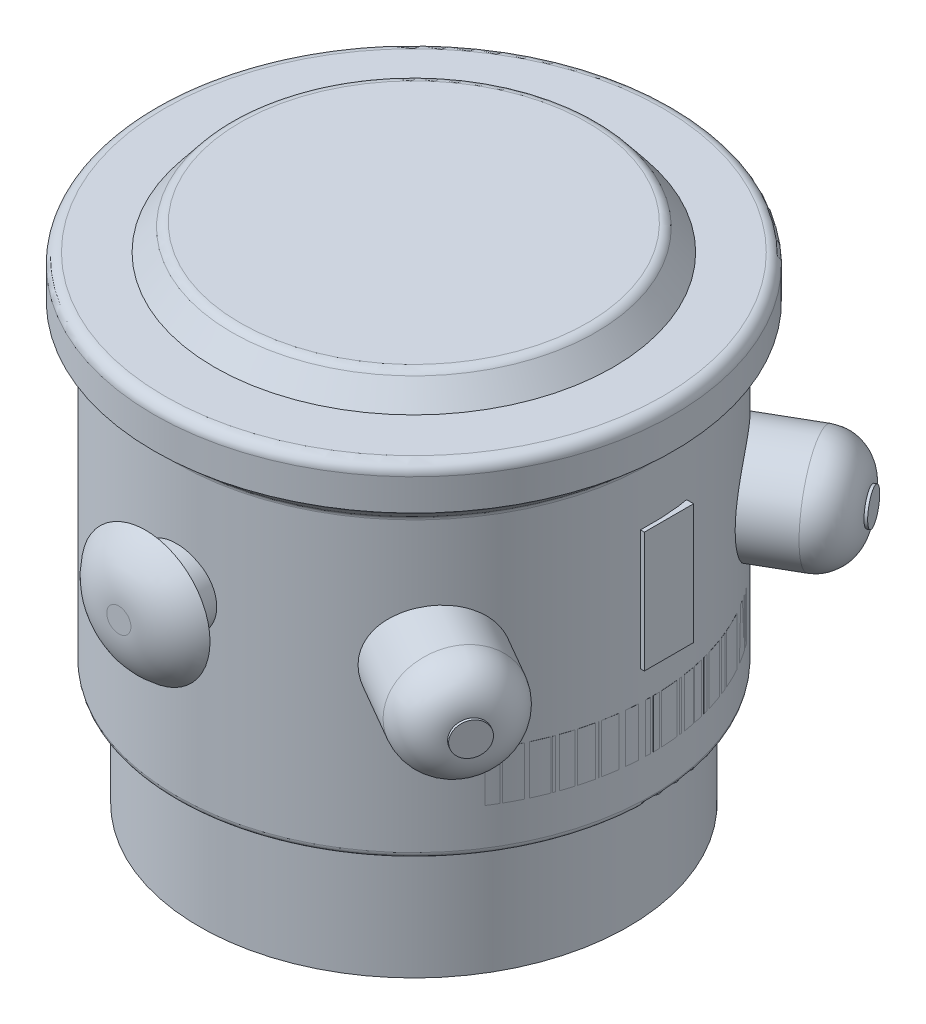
ISO-10303-21;
HEADER;
FILE_DESCRIPTION(('STEP AP214'),'2;1');
FILE_NAME('part.step','',(''),(''),'','','');
FILE_SCHEMA(('AUTOMOTIVE_DESIGN { 1 0 10303 214 1 1 1 1 }'));
ENDSEC;
DATA;
#1=APPLICATION_CONTEXT('core data for automotive mechanical design processes');
#2=APPLICATION_PROTOCOL_DEFINITION('international standard','automotive_design',2000,#1);
#3=PRODUCT_CONTEXT('',#1,'mechanical');
#4=PRODUCT('Part','Part','',(#3));
#5=PRODUCT_RELATED_PRODUCT_CATEGORY('part','',(#4));
#6=PRODUCT_DEFINITION_FORMATION('','',#4);
#7=PRODUCT_DEFINITION_CONTEXT('part definition',#1,'design');
#8=PRODUCT_DEFINITION('design','',#6,#7);
#9=PRODUCT_DEFINITION_SHAPE('','',#8);
#10=(LENGTH_UNIT() NAMED_UNIT(*) SI_UNIT(.MILLI.,.METRE.));
#11=(NAMED_UNIT(*) PLANE_ANGLE_UNIT() SI_UNIT($,.RADIAN.));
#12=(NAMED_UNIT(*) SI_UNIT($,.STERADIAN.) SOLID_ANGLE_UNIT());
#13=UNCERTAINTY_MEASURE_WITH_UNIT(LENGTH_MEASURE(1.E-05),#10,'distance_accuracy_value','');
#14=(GEOMETRIC_REPRESENTATION_CONTEXT(3) GLOBAL_UNCERTAINTY_ASSIGNED_CONTEXT((#13)) GLOBAL_UNIT_ASSIGNED_CONTEXT((#10,
#11,#12)) REPRESENTATION_CONTEXT('',''));
#15=CARTESIAN_POINT('',(0.,0.,0.));
#16=DIRECTION('',(0.,0.,1.));
#17=DIRECTION('',(1.,0.,0.));
#18=AXIS2_PLACEMENT_3D('',#15,#16,#17);
#19=CARTESIAN_POINT('',(10.0403923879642,4.0104303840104,3.04890271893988));
#20=DIRECTION('',(0.,0.,1.));
#21=DIRECTION('',(1.,0.,0.));
#22=AXIS2_PLACEMENT_3D('',#19,#20,#21);
#23=PLANE('',#22);
#24=DIRECTION('',(0.,-1.,0.));
#25=VECTOR('',#24,1.);
#26=CARTESIAN_POINT('',(8.32072744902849,0.,3.04890271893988));
#27=LINE('',#26,#25);
#28=CARTESIAN_POINT('',(8.32072744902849,4.0104303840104,3.04890271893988));
#29=VERTEX_POINT('',#28);
#30=CARTESIAN_POINT('',(8.32072744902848,5.82949175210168,3.04890271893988));
#31=VERTEX_POINT('',#30);
#32=EDGE_CURVE('E87',#29,#31,#27,.F.);
#33=ORIENTED_EDGE('',*,*,#32,.F.);
#34=DIRECTION('',(-1.,0.,0.));
#35=VECTOR('',#34,1.);
#36=CARTESIAN_POINT('',(10.0403923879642,4.0104303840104,3.04890271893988));
#37=LINE('',#36,#35);
#38=CARTESIAN_POINT('',(0.,4.0104303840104,3.04890271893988));
#39=VERTEX_POINT('',#38);
#40=EDGE_CURVE('E41',#29,#39,#37,.T.);
#41=ORIENTED_EDGE('',*,*,#40,.T.);
#42=DIRECTION('',(0.,1.,0.));
#43=VECTOR('',#42,1.);
#44=CARTESIAN_POINT('',(0.,4.0104303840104,3.04890271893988));
#45=LINE('',#44,#43);
#46=CARTESIAN_POINT('',(0.,5.82949175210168,3.04890271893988));
#47=VERTEX_POINT('',#46);
#48=EDGE_CURVE('E85',#39,#47,#45,.T.);
#49=ORIENTED_EDGE('',*,*,#48,.T.);
#50=DIRECTION('',(-1.,0.,0.));
#51=VECTOR('',#50,1.);
#52=CARTESIAN_POINT('',(10.0403923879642,5.82949175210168,3.04890271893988));
#53=LINE('',#52,#51);
#54=EDGE_CURVE('E76',#31,#47,#53,.T.);
#55=ORIENTED_EDGE('',*,*,#54,.F.);
#56=EDGE_LOOP('',(#33,#41,#49,#55));
#57=FACE_BOUND('',#56,.T.);
#58=ADVANCED_FACE('F37',(#57),#23,.F.);
#59=CARTESIAN_POINT('',(10.0403923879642,5.82949175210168,3.04890271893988));
#60=DIRECTION('',(0.,-1.,0.));
#61=DIRECTION('',(0.,0.,-1.));
#62=AXIS2_PLACEMENT_3D('',#59,#60,#61);
#63=PLANE('',#62);
#64=CARTESIAN_POINT('',(0.,5.82949175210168,0.));
#65=DIRECTION('',(0.,-1.,0.));
#66=DIRECTION('',(0.,0.,-1.));
#67=AXIS2_PLACEMENT_3D('',#64,#65,#66);
#68=CIRCLE('',#67,8.86173307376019);
#69=CARTESIAN_POINT('',(8.04001321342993,5.82949175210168,3.7267278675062));
#70=VERTEX_POINT('',#69);
#71=EDGE_CURVE('E46',#31,#70,#68,.T.);
#72=ORIENTED_EDGE('',*,*,#71,.F.);
#73=ORIENTED_EDGE('',*,*,#54,.T.);
#74=DIRECTION('',(0.,0.,1.));
#75=VECTOR('',#74,1.);
#76=CARTESIAN_POINT('',(0.,5.82949175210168,3.04890271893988));
#77=LINE('',#76,#75);
#78=CARTESIAN_POINT('',(0.,5.82949175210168,3.7267278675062));
#79=VERTEX_POINT('',#78);
#80=EDGE_CURVE('E97',#47,#79,#77,.T.);
#81=ORIENTED_EDGE('',*,*,#80,.T.);
#82=DIRECTION('',(-1.,0.,0.));
#83=VECTOR('',#82,1.);
#84=CARTESIAN_POINT('',(10.0403923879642,5.82949175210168,3.7267278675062));
#85=LINE('',#84,#83);
#86=EDGE_CURVE('E106',#70,#79,#85,.T.);
#87=ORIENTED_EDGE('',*,*,#86,.F.);
#88=EDGE_LOOP('',(#72,#73,#81,#87));
#89=FACE_BOUND('',#88,.T.);
#90=ADVANCED_FACE('F110',(#89),#63,.F.);
#91=CARTESIAN_POINT('',(10.0403923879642,4.0104303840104,3.7267278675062));
#92=DIRECTION('',(0.,0.,-1.));
#93=DIRECTION('',(-1.,0.,0.));
#94=AXIS2_PLACEMENT_3D('',#91,#92,#93);
#95=PLANE('',#94);
#96=DIRECTION('',(0.,-1.,0.));
#97=VECTOR('',#96,1.);
#98=CARTESIAN_POINT('',(8.04001321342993,0.,3.7267278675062));
#99=LINE('',#98,#97);
#100=CARTESIAN_POINT('',(8.04001321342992,4.0104303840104,3.7267278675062));
#101=VERTEX_POINT('',#100);
#102=EDGE_CURVE('E12',#70,#101,#99,.T.);
#103=ORIENTED_EDGE('',*,*,#102,.F.);
#104=ORIENTED_EDGE('',*,*,#86,.T.);
#105=DIRECTION('',(0.,-1.,0.));
#106=VECTOR('',#105,1.);
#107=CARTESIAN_POINT('',(0.,4.0104303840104,3.7267278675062));
#108=LINE('',#107,#106);
#109=CARTESIAN_POINT('',(0.,4.0104303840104,3.7267278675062));
#110=VERTEX_POINT('',#109);
#111=EDGE_CURVE('E107',#79,#110,#108,.T.);
#112=ORIENTED_EDGE('',*,*,#111,.T.);
#113=DIRECTION('',(-1.,0.,0.));
#114=VECTOR('',#113,1.);
#115=CARTESIAN_POINT('',(10.0403923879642,4.0104303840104,3.7267278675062));
#116=LINE('',#115,#114);
#117=EDGE_CURVE('E59',#101,#110,#116,.T.);
#118=ORIENTED_EDGE('',*,*,#117,.F.);
#119=EDGE_LOOP('',(#103,#104,#112,#118));
#120=FACE_BOUND('',#119,.T.);
#121=ADVANCED_FACE('F109',(#120),#95,.F.);
#122=CARTESIAN_POINT('',(10.0403923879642,4.0104303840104,3.04890271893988));
#123=DIRECTION('',(0.,1.,0.));
#124=DIRECTION('',(0.,0.,1.));
#125=AXIS2_PLACEMENT_3D('',#122,#123,#124);
#126=PLANE('',#125);
#127=CARTESIAN_POINT('',(0.,4.0104303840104,0.));
#128=DIRECTION('',(0.,1.,0.));
#129=DIRECTION('',(0.,0.,1.));
#130=AXIS2_PLACEMENT_3D('',#127,#128,#129);
#131=CIRCLE('',#130,8.86173307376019);
#132=EDGE_CURVE('E94',#101,#29,#131,.T.);
#133=ORIENTED_EDGE('',*,*,#132,.F.);
#134=ORIENTED_EDGE('',*,*,#117,.T.);
#135=DIRECTION('',(0.,0.,-1.));
#136=VECTOR('',#135,1.);
#137=CARTESIAN_POINT('',(0.,4.0104303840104,3.04890271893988));
#138=LINE('',#137,#136);
#139=EDGE_CURVE('E90',#110,#39,#138,.T.);
#140=ORIENTED_EDGE('',*,*,#139,.T.);
#141=ORIENTED_EDGE('',*,*,#40,.F.);
#142=EDGE_LOOP('',(#133,#134,#140,#141));
#143=FACE_BOUND('',#142,.T.);
#144=ADVANCED_FACE('F91',(#143),#126,.F.);
#145=CARTESIAN_POINT('',(0.,5.82949175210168,3.04890271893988));
#146=DIRECTION('',(1.,0.,0.));
#147=DIRECTION('',(0.,0.,-1.));
#148=AXIS2_PLACEMENT_3D('',#145,#146,#147);
#149=PLANE('',#148);
#150=ORIENTED_EDGE('',*,*,#48,.F.);
#151=ORIENTED_EDGE('',*,*,#139,.F.);
#152=ORIENTED_EDGE('',*,*,#111,.F.);
#153=ORIENTED_EDGE('',*,*,#80,.F.);
#154=EDGE_LOOP('',(#150,#151,#152,#153));
#155=FACE_BOUND('',#154,.T.);
#156=ADVANCED_FACE('F96',(#155),#149,.F.);
#157=CARTESIAN_POINT('',(0.,0.,0.));
#158=DIRECTION('',(0.,-1.,0.));
#159=DIRECTION('',(0.,0.,-1.));
#160=AXIS2_PLACEMENT_3D('',#157,#158,#159);
#161=CYLINDRICAL_SURFACE('',#160,8.86173307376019);
#162=ORIENTED_EDGE('',*,*,#132,.T.);
#163=ORIENTED_EDGE('',*,*,#32,.T.);
#164=ORIENTED_EDGE('',*,*,#71,.T.);
#165=ORIENTED_EDGE('',*,*,#102,.T.);
#166=EDGE_LOOP('',(#162,#163,#164,#165));
#167=FACE_BOUND('',#166,.T.);
#168=ADVANCED_FACE('F39',(#167),#161,.T.);
#169=CLOSED_SHELL('',(#58,#90,#121,#144,#156,#168));
#170=MANIFOLD_SOLID_BREP('B2',#169);
#171=CARTESIAN_POINT('',(10.0403923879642,5.82949175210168,1.89383333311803));
#172=DIRECTION('',(0.,0.,1.));
#173=DIRECTION('',(0.,-1.,0.));
#174=AXIS2_PLACEMENT_3D('',#171,#172,#173);
#175=PLANE('',#174);
#176=DIRECTION('',(0.,-1.,0.));
#177=VECTOR('',#176,1.);
#178=CARTESIAN_POINT('',(8.65700342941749,0.,1.89383333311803));
#179=LINE('',#178,#177);
#180=CARTESIAN_POINT('',(8.65700342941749,4.0104303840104,1.89383333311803));
#181=VERTEX_POINT('',#180);
#182=CARTESIAN_POINT('',(8.65700342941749,5.82949175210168,1.89383333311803));
#183=VERTEX_POINT('',#182);
#184=EDGE_CURVE('E208',#181,#183,#179,.F.);
#185=ORIENTED_EDGE('',*,*,#184,.F.);
#186=DIRECTION('',(-1.,0.,0.));
#187=VECTOR('',#186,1.);
#188=CARTESIAN_POINT('',(10.0403923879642,4.0104303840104,1.89383333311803));
#189=LINE('',#188,#187);
#190=CARTESIAN_POINT('',(0.,4.0104303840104,1.89383333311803));
#191=VERTEX_POINT('',#190);
#192=EDGE_CURVE('E162',#181,#191,#189,.T.);
#193=ORIENTED_EDGE('',*,*,#192,.T.);
#194=DIRECTION('',(0.,1.,0.));
#195=VECTOR('',#194,1.);
#196=CARTESIAN_POINT('',(0.,5.82949175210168,1.89383333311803));
#197=LINE('',#196,#195);
#198=CARTESIAN_POINT('',(0.,5.82949175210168,1.89383333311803));
#199=VERTEX_POINT('',#198);
#200=EDGE_CURVE('E206',#191,#199,#197,.T.);
#201=ORIENTED_EDGE('',*,*,#200,.T.);
#202=DIRECTION('',(-1.,0.,0.));
#203=VECTOR('',#202,1.);
#204=CARTESIAN_POINT('',(10.0403923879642,5.82949175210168,1.89383333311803));
#205=LINE('',#204,#203);
#206=EDGE_CURVE('E197',#183,#199,#205,.T.);
#207=ORIENTED_EDGE('',*,*,#206,.F.);
#208=EDGE_LOOP('',(#185,#193,#201,#207));
#209=FACE_BOUND('',#208,.T.);
#210=ADVANCED_FACE('F158',(#209),#175,.F.);
#211=CARTESIAN_POINT('',(10.0403923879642,5.82949175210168,1.89383333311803));
#212=DIRECTION('',(0.,-1.,0.));
#213=DIRECTION('',(0.,0.,-1.));
#214=AXIS2_PLACEMENT_3D('',#211,#212,#213);
#215=PLANE('',#214);
#216=CARTESIAN_POINT('',(0.,5.82949175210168,0.));
#217=DIRECTION('',(0.,-1.,0.));
#218=DIRECTION('',(0.,0.,-1.));
#219=AXIS2_PLACEMENT_3D('',#216,#217,#218);
#220=CIRCLE('',#219,8.86173307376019);
#221=CARTESIAN_POINT('',(8.36473008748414,5.82949175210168,2.92602181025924));
#222=VERTEX_POINT('',#221);
#223=EDGE_CURVE('E167',#183,#222,#220,.T.);
#224=ORIENTED_EDGE('',*,*,#223,.F.);
#225=ORIENTED_EDGE('',*,*,#206,.T.);
#226=DIRECTION('',(0.,0.,1.));
#227=VECTOR('',#226,1.);
#228=CARTESIAN_POINT('',(0.,5.82949175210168,1.89383333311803));
#229=LINE('',#228,#227);
#230=CARTESIAN_POINT('',(0.,5.82949175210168,2.92602181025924));
#231=VERTEX_POINT('',#230);
#232=EDGE_CURVE('E218',#199,#231,#229,.T.);
#233=ORIENTED_EDGE('',*,*,#232,.T.);
#234=DIRECTION('',(-1.,0.,0.));
#235=VECTOR('',#234,1.);
#236=CARTESIAN_POINT('',(10.0403923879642,5.82949175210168,2.92602181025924));
#237=LINE('',#236,#235);
#238=EDGE_CURVE('E227',#222,#231,#237,.T.);
#239=ORIENTED_EDGE('',*,*,#238,.F.);
#240=EDGE_LOOP('',(#224,#225,#233,#239));
#241=FACE_BOUND('',#240,.T.);
#242=ADVANCED_FACE('F231',(#241),#215,.F.);
#243=CARTESIAN_POINT('',(10.0403923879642,5.82949175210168,2.92602181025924));
#244=DIRECTION('',(0.,0.,-1.));
#245=DIRECTION('',(-1.,0.,0.));
#246=AXIS2_PLACEMENT_3D('',#243,#244,#245);
#247=PLANE('',#246);
#248=DIRECTION('',(0.,-1.,0.));
#249=VECTOR('',#248,1.);
#250=CARTESIAN_POINT('',(8.36473008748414,0.,2.92602181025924));
#251=LINE('',#250,#249);
#252=CARTESIAN_POINT('',(8.36473008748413,4.0104303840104,2.92602181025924));
#253=VERTEX_POINT('',#252);
#254=EDGE_CURVE('E35',#222,#253,#251,.T.);
#255=ORIENTED_EDGE('',*,*,#254,.F.);
#256=ORIENTED_EDGE('',*,*,#238,.T.);
#257=DIRECTION('',(0.,-1.,0.));
#258=VECTOR('',#257,1.);
#259=CARTESIAN_POINT('',(0.,5.82949175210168,2.92602181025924));
#260=LINE('',#259,#258);
#261=CARTESIAN_POINT('',(0.,4.0104303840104,2.92602181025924));
#262=VERTEX_POINT('',#261);
#263=EDGE_CURVE('E228',#231,#262,#260,.T.);
#264=ORIENTED_EDGE('',*,*,#263,.T.);
#265=DIRECTION('',(-1.,0.,0.));
#266=VECTOR('',#265,1.);
#267=CARTESIAN_POINT('',(10.0403923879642,4.0104303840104,2.92602181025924));
#268=LINE('',#267,#266);
#269=EDGE_CURVE('E180',#253,#262,#268,.T.);
#270=ORIENTED_EDGE('',*,*,#269,.F.);
#271=EDGE_LOOP('',(#255,#256,#264,#270));
#272=FACE_BOUND('',#271,.T.);
#273=ADVANCED_FACE('F230',(#272),#247,.F.);
#274=CARTESIAN_POINT('',(10.0403923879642,4.0104303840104,1.89383333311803));
#275=DIRECTION('',(0.,1.,0.));
#276=DIRECTION('',(0.,0.,1.));
#277=AXIS2_PLACEMENT_3D('',#274,#275,#276);
#278=PLANE('',#277);
#279=CARTESIAN_POINT('',(0.,4.0104303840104,0.));
#280=DIRECTION('',(0.,1.,0.));
#281=DIRECTION('',(0.,0.,1.));
#282=AXIS2_PLACEMENT_3D('',#279,#280,#281);
#283=CIRCLE('',#282,8.86173307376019);
#284=EDGE_CURVE('E215',#253,#181,#283,.T.);
#285=ORIENTED_EDGE('',*,*,#284,.F.);
#286=ORIENTED_EDGE('',*,*,#269,.T.);
#287=DIRECTION('',(0.,0.,-1.));
#288=VECTOR('',#287,1.);
#289=CARTESIAN_POINT('',(0.,4.0104303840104,1.89383333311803));
#290=LINE('',#289,#288);
#291=EDGE_CURVE('E211',#262,#191,#290,.T.);
#292=ORIENTED_EDGE('',*,*,#291,.T.);
#293=ORIENTED_EDGE('',*,*,#192,.F.);
#294=EDGE_LOOP('',(#285,#286,#292,#293));
#295=FACE_BOUND('',#294,.T.);
#296=ADVANCED_FACE('F212',(#295),#278,.F.);
#297=CARTESIAN_POINT('',(0.,4.0104303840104,1.89383333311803));
#298=DIRECTION('',(-1.,0.,0.));
#299=DIRECTION('',(0.,0.,1.));
#300=AXIS2_PLACEMENT_3D('',#297,#298,#299);
#301=PLANE('',#300);
#302=ORIENTED_EDGE('',*,*,#200,.F.);
#303=ORIENTED_EDGE('',*,*,#291,.F.);
#304=ORIENTED_EDGE('',*,*,#263,.F.);
#305=ORIENTED_EDGE('',*,*,#232,.F.);
#306=EDGE_LOOP('',(#302,#303,#304,#305));
#307=FACE_BOUND('',#306,.T.);
#308=ADVANCED_FACE('F217',(#307),#301,.T.);
#309=CARTESIAN_POINT('',(0.,0.,0.));
#310=DIRECTION('',(0.,-1.,0.));
#311=DIRECTION('',(0.,0.,-1.));
#312=AXIS2_PLACEMENT_3D('',#309,#310,#311);
#313=CYLINDRICAL_SURFACE('',#312,8.86173307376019);
#314=ORIENTED_EDGE('',*,*,#284,.T.);
#315=ORIENTED_EDGE('',*,*,#184,.T.);
#316=ORIENTED_EDGE('',*,*,#223,.T.);
#317=ORIENTED_EDGE('',*,*,#254,.T.);
#318=EDGE_LOOP('',(#314,#315,#316,#317));
#319=FACE_BOUND('',#318,.T.);
#320=ADVANCED_FACE('F160',(#319),#313,.T.);
#321=CLOSED_SHELL('',(#210,#242,#273,#296,#308,#320));
#322=MANIFOLD_SOLID_BREP('B6',#321);
#323=CARTESIAN_POINT('',(10.0403923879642,4.0104303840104,0.0332724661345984));
#324=DIRECTION('',(0.,0.,1.));
#325=DIRECTION('',(1.,0.,0.));
#326=AXIS2_PLACEMENT_3D('',#323,#324,#325);
#327=PLANE('',#326);
#328=DIRECTION('',(0.,-1.,0.));
#329=VECTOR('',#328,1.);
#330=CARTESIAN_POINT('',(8.86167061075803,0.,0.0332724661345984));
#331=LINE('',#330,#329);
#332=CARTESIAN_POINT('',(8.86167061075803,4.0104303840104,0.0332724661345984));
#333=VERTEX_POINT('',#332);
#334=CARTESIAN_POINT('',(8.86167061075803,5.82949175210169,0.0332724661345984));
#335=VERTEX_POINT('',#334);
#336=EDGE_CURVE('E329',#333,#335,#331,.F.);
#337=ORIENTED_EDGE('',*,*,#336,.F.);
#338=DIRECTION('',(-1.,0.,0.));
#339=VECTOR('',#338,1.);
#340=CARTESIAN_POINT('',(10.0403923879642,4.0104303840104,0.0332724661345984));
#341=LINE('',#340,#339);
#342=CARTESIAN_POINT('',(0.,4.0104303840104,0.0332724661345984));
#343=VERTEX_POINT('',#342);
#344=EDGE_CURVE('E283',#333,#343,#341,.T.);
#345=ORIENTED_EDGE('',*,*,#344,.T.);
#346=DIRECTION('',(0.,1.,0.));
#347=VECTOR('',#346,1.);
#348=CARTESIAN_POINT('',(0.,4.0104303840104,0.0332724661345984));
#349=LINE('',#348,#347);
#350=CARTESIAN_POINT('',(0.,5.82949175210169,0.0332724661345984));
#351=VERTEX_POINT('',#350);
#352=EDGE_CURVE('E327',#343,#351,#349,.T.);
#353=ORIENTED_EDGE('',*,*,#352,.T.);
#354=DIRECTION('',(-1.,0.,0.));
#355=VECTOR('',#354,1.);
#356=CARTESIAN_POINT('',(10.0403923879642,5.82949175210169,0.0332724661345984));
#357=LINE('',#356,#355);
#358=EDGE_CURVE('E318',#335,#351,#357,.T.);
#359=ORIENTED_EDGE('',*,*,#358,.F.);
#360=EDGE_LOOP('',(#337,#345,#353,#359));
#361=FACE_BOUND('',#360,.T.);
#362=ADVANCED_FACE('F279',(#361),#327,.F.);
#363=CARTESIAN_POINT('',(10.0403923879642,5.82949175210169,0.0332724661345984));
#364=DIRECTION('',(0.,-1.,0.));
#365=DIRECTION('',(0.,0.,-1.));
#366=AXIS2_PLACEMENT_3D('',#363,#364,#365);
#367=PLANE('',#366);
#368=CARTESIAN_POINT('',(0.,5.82949175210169,0.));
#369=DIRECTION('',(0.,-1.,0.));
#370=DIRECTION('',(0.,0.,-1.));
#371=AXIS2_PLACEMENT_3D('',#368,#369,#370);
#372=CIRCLE('',#371,8.86173307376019);
#373=CARTESIAN_POINT('',(8.67779385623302,5.82949175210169,1.79616448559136));
#374=VERTEX_POINT('',#373);
#375=EDGE_CURVE('E288',#335,#374,#372,.T.);
#376=ORIENTED_EDGE('',*,*,#375,.F.);
#377=ORIENTED_EDGE('',*,*,#358,.T.);
#378=DIRECTION('',(0.,0.,1.));
#379=VECTOR('',#378,1.);
#380=CARTESIAN_POINT('',(0.,5.82949175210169,0.0332724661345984));
#381=LINE('',#380,#379);
#382=CARTESIAN_POINT('',(0.,5.82949175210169,1.79616448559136));
#383=VERTEX_POINT('',#382);
#384=EDGE_CURVE('E339',#351,#383,#381,.T.);
#385=ORIENTED_EDGE('',*,*,#384,.T.);
#386=DIRECTION('',(-1.,0.,0.));
#387=VECTOR('',#386,1.);
#388=CARTESIAN_POINT('',(10.0403923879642,5.82949175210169,1.79616448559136));
#389=LINE('',#388,#387);
#390=EDGE_CURVE('E348',#374,#383,#389,.T.);
#391=ORIENTED_EDGE('',*,*,#390,.F.);
#392=EDGE_LOOP('',(#376,#377,#385,#391));
#393=FACE_BOUND('',#392,.T.);
#394=ADVANCED_FACE('F352',(#393),#367,.F.);
#395=CARTESIAN_POINT('',(10.0403923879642,4.0104303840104,1.79616448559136));
#396=DIRECTION('',(0.,0.,-1.));
#397=DIRECTION('',(-1.,0.,0.));
#398=AXIS2_PLACEMENT_3D('',#395,#396,#397);
#399=PLANE('',#398);
#400=DIRECTION('',(0.,-1.,0.));
#401=VECTOR('',#400,1.);
#402=CARTESIAN_POINT('',(8.67779385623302,0.,1.79616448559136));
#403=LINE('',#402,#401);
#404=CARTESIAN_POINT('',(8.67779385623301,4.0104303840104,1.79616448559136));
#405=VERTEX_POINT('',#404);
#406=EDGE_CURVE('E156',#374,#405,#403,.T.);
#407=ORIENTED_EDGE('',*,*,#406,.F.);
#408=ORIENTED_EDGE('',*,*,#390,.T.);
#409=DIRECTION('',(0.,-1.,0.));
#410=VECTOR('',#409,1.);
#411=CARTESIAN_POINT('',(0.,4.0104303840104,1.79616448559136));
#412=LINE('',#411,#410);
#413=CARTESIAN_POINT('',(0.,4.0104303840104,1.79616448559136));
#414=VERTEX_POINT('',#413);
#415=EDGE_CURVE('E349',#383,#414,#412,.T.);
#416=ORIENTED_EDGE('',*,*,#415,.T.);
#417=DIRECTION('',(-1.,0.,0.));
#418=VECTOR('',#417,1.);
#419=CARTESIAN_POINT('',(10.0403923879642,4.0104303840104,1.79616448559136));
#420=LINE('',#419,#418);
#421=EDGE_CURVE('E301',#405,#414,#420,.T.);
#422=ORIENTED_EDGE('',*,*,#421,.F.);
#423=EDGE_LOOP('',(#407,#408,#416,#422));
#424=FACE_BOUND('',#423,.T.);
#425=ADVANCED_FACE('F351',(#424),#399,.F.);
#426=CARTESIAN_POINT('',(10.0403923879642,4.0104303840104,0.0332724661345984));
#427=DIRECTION('',(0.,1.,0.));
#428=DIRECTION('',(0.,0.,1.));
#429=AXIS2_PLACEMENT_3D('',#426,#427,#428);
#430=PLANE('',#429);
#431=CARTESIAN_POINT('',(0.,4.0104303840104,0.));
#432=DIRECTION('',(0.,1.,0.));
#433=DIRECTION('',(0.,0.,1.));
#434=AXIS2_PLACEMENT_3D('',#431,#432,#433);
#435=CIRCLE('',#434,8.86173307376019);
#436=EDGE_CURVE('E336',#405,#333,#435,.T.);
#437=ORIENTED_EDGE('',*,*,#436,.F.);
#438=ORIENTED_EDGE('',*,*,#421,.T.);
#439=DIRECTION('',(0.,0.,-1.));
#440=VECTOR('',#439,1.);
#441=CARTESIAN_POINT('',(0.,4.0104303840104,0.0332724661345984));
#442=LINE('',#441,#440);
#443=EDGE_CURVE('E332',#414,#343,#442,.T.);
#444=ORIENTED_EDGE('',*,*,#443,.T.);
#445=ORIENTED_EDGE('',*,*,#344,.F.);
#446=EDGE_LOOP('',(#437,#438,#444,#445));
#447=FACE_BOUND('',#446,.T.);
#448=ADVANCED_FACE('F333',(#447),#430,.F.);
#449=CARTESIAN_POINT('',(0.,5.82949175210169,0.0332724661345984));
#450=DIRECTION('',(1.,0.,0.));
#451=DIRECTION('',(0.,0.,-1.));
#452=AXIS2_PLACEMENT_3D('',#449,#450,#451);
#453=PLANE('',#452);
#454=ORIENTED_EDGE('',*,*,#352,.F.);
#455=ORIENTED_EDGE('',*,*,#443,.F.);
#456=ORIENTED_EDGE('',*,*,#415,.F.);
#457=ORIENTED_EDGE('',*,*,#384,.F.);
#458=EDGE_LOOP('',(#454,#455,#456,#457));
#459=FACE_BOUND('',#458,.T.);
#460=ADVANCED_FACE('F338',(#459),#453,.F.);
#461=CARTESIAN_POINT('',(0.,0.,0.));
#462=DIRECTION('',(0.,-1.,0.));
#463=DIRECTION('',(0.,0.,-1.));
#464=AXIS2_PLACEMENT_3D('',#461,#462,#463);
#465=CYLINDRICAL_SURFACE('',#464,8.86173307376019);
#466=ORIENTED_EDGE('',*,*,#436,.T.);
#467=ORIENTED_EDGE('',*,*,#336,.T.);
#468=ORIENTED_EDGE('',*,*,#375,.T.);
#469=ORIENTED_EDGE('',*,*,#406,.T.);
#470=EDGE_LOOP('',(#466,#467,#468,#469));
#471=FACE_BOUND('',#470,.T.);
#472=ADVANCED_FACE('F281',(#471),#465,.T.);
#473=CLOSED_SHELL('',(#362,#394,#425,#448,#460,#472));
#474=MANIFOLD_SOLID_BREP('B29',#473);
#475=CARTESIAN_POINT('',(10.0403923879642,4.0104303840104,-1.1978793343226));
#476=DIRECTION('',(0.,0.,1.));
#477=DIRECTION('',(1.,0.,0.));
#478=AXIS2_PLACEMENT_3D('',#475,#476,#477);
#479=PLANE('',#478);
#480=DIRECTION('',(0.,-1.,0.));
#481=VECTOR('',#480,1.);
#482=CARTESIAN_POINT('',(8.78039852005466,0.,-1.1978793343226));
#483=LINE('',#482,#481);
#484=CARTESIAN_POINT('',(8.78039852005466,4.0104303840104,-1.1978793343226));
#485=VERTEX_POINT('',#484);
#486=CARTESIAN_POINT('',(8.78039852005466,5.82949175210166,-1.1978793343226));
#487=VERTEX_POINT('',#486);
#488=EDGE_CURVE('E450',#485,#487,#483,.F.);
#489=ORIENTED_EDGE('',*,*,#488,.F.);
#490=DIRECTION('',(-1.,0.,0.));
#491=VECTOR('',#490,1.);
#492=CARTESIAN_POINT('',(10.0403923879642,4.0104303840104,-1.1978793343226));
#493=LINE('',#492,#491);
#494=CARTESIAN_POINT('',(0.,4.0104303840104,-1.1978793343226));
#495=VERTEX_POINT('',#494);
#496=EDGE_CURVE('E404',#485,#495,#493,.T.);
#497=ORIENTED_EDGE('',*,*,#496,.T.);
#498=DIRECTION('',(0.,1.,0.));
#499=VECTOR('',#498,1.);
#500=CARTESIAN_POINT('',(0.,4.0104303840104,-1.1978793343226));
#501=LINE('',#500,#499);
#502=CARTESIAN_POINT('',(0.,5.82949175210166,-1.1978793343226));
#503=VERTEX_POINT('',#502);
#504=EDGE_CURVE('E448',#495,#503,#501,.T.);
#505=ORIENTED_EDGE('',*,*,#504,.T.);
#506=DIRECTION('',(-1.,0.,0.));
#507=VECTOR('',#506,1.);
#508=CARTESIAN_POINT('',(10.0403923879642,5.82949175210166,-1.1978793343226));
#509=LINE('',#508,#507);
#510=EDGE_CURVE('E439',#487,#503,#509,.T.);
#511=ORIENTED_EDGE('',*,*,#510,.F.);
#512=EDGE_LOOP('',(#489,#497,#505,#511));
#513=FACE_BOUND('',#512,.T.);
#514=ADVANCED_FACE('F400',(#513),#479,.F.);
#515=CARTESIAN_POINT('',(10.0403923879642,5.82949175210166,-1.1978793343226));
#516=DIRECTION('',(0.,-1.,0.));
#517=DIRECTION('',(0.,0.,-1.));
#518=AXIS2_PLACEMENT_3D('',#515,#516,#517);
#519=PLANE('',#518);
#520=CARTESIAN_POINT('',(0.,5.82949175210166,0.));
#521=DIRECTION('',(0.,-1.,0.));
#522=DIRECTION('',(0.,0.,-1.));
#523=AXIS2_PLACEMENT_3D('',#520,#521,#522);
#524=CIRCLE('',#523,8.86173307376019);
#525=CARTESIAN_POINT('',(8.8614528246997,5.82949175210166,-0.0704762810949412));
#526=VERTEX_POINT('',#525);
#527=EDGE_CURVE('E409',#487,#526,#524,.T.);
#528=ORIENTED_EDGE('',*,*,#527,.F.);
#529=ORIENTED_EDGE('',*,*,#510,.T.);
#530=DIRECTION('',(0.,0.,1.));
#531=VECTOR('',#530,1.);
#532=CARTESIAN_POINT('',(0.,5.82949175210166,-1.1978793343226));
#533=LINE('',#532,#531);
#534=CARTESIAN_POINT('',(0.,5.82949175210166,-0.0704762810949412));
#535=VERTEX_POINT('',#534);
#536=EDGE_CURVE('E460',#503,#535,#533,.T.);
#537=ORIENTED_EDGE('',*,*,#536,.T.);
#538=DIRECTION('',(-1.,0.,0.));
#539=VECTOR('',#538,1.);
#540=CARTESIAN_POINT('',(10.0403923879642,5.82949175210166,-0.0704762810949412));
#541=LINE('',#540,#539);
#542=EDGE_CURVE('E469',#526,#535,#541,.T.);
#543=ORIENTED_EDGE('',*,*,#542,.F.);
#544=EDGE_LOOP('',(#528,#529,#537,#543));
#545=FACE_BOUND('',#544,.T.);
#546=ADVANCED_FACE('F473',(#545),#519,.F.);
#547=CARTESIAN_POINT('',(10.0403923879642,4.0104303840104,-0.0704762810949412));
#548=DIRECTION('',(0.,0.,-1.));
#549=DIRECTION('',(-1.,0.,0.));
#550=AXIS2_PLACEMENT_3D('',#547,#548,#549);
#551=PLANE('',#550);
#552=DIRECTION('',(0.,-1.,0.));
#553=VECTOR('',#552,1.);
#554=CARTESIAN_POINT('',(8.8614528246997,0.,-0.0704762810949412));
#555=LINE('',#554,#553);
#556=CARTESIAN_POINT('',(8.8614528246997,4.0104303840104,-0.0704762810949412));
#557=VERTEX_POINT('',#556);
#558=EDGE_CURVE('E277',#526,#557,#555,.T.);
#559=ORIENTED_EDGE('',*,*,#558,.F.);
#560=ORIENTED_EDGE('',*,*,#542,.T.);
#561=DIRECTION('',(0.,-1.,0.));
#562=VECTOR('',#561,1.);
#563=CARTESIAN_POINT('',(0.,4.0104303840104,-0.0704762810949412));
#564=LINE('',#563,#562);
#565=CARTESIAN_POINT('',(0.,4.0104303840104,-0.0704762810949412));
#566=VERTEX_POINT('',#565);
#567=EDGE_CURVE('E470',#535,#566,#564,.T.);
#568=ORIENTED_EDGE('',*,*,#567,.T.);
#569=DIRECTION('',(-1.,0.,0.));
#570=VECTOR('',#569,1.);
#571=CARTESIAN_POINT('',(10.0403923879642,4.0104303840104,-0.0704762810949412));
#572=LINE('',#571,#570);
#573=EDGE_CURVE('E422',#557,#566,#572,.T.);
#574=ORIENTED_EDGE('',*,*,#573,.F.);
#575=EDGE_LOOP('',(#559,#560,#568,#574));
#576=FACE_BOUND('',#575,.T.);
#577=ADVANCED_FACE('F472',(#576),#551,.F.);
#578=CARTESIAN_POINT('',(10.0403923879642,4.0104303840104,-1.1978793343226));
#579=DIRECTION('',(0.,1.,0.));
#580=DIRECTION('',(0.,0.,1.));
#581=AXIS2_PLACEMENT_3D('',#578,#579,#580);
#582=PLANE('',#581);
#583=CARTESIAN_POINT('',(0.,4.0104303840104,0.));
#584=DIRECTION('',(0.,1.,0.));
#585=DIRECTION('',(0.,0.,1.));
#586=AXIS2_PLACEMENT_3D('',#583,#584,#585);
#587=CIRCLE('',#586,8.86173307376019);
#588=EDGE_CURVE('E457',#557,#485,#587,.T.);
#589=ORIENTED_EDGE('',*,*,#588,.F.);
#590=ORIENTED_EDGE('',*,*,#573,.T.);
#591=DIRECTION('',(0.,0.,-1.));
#592=VECTOR('',#591,1.);
#593=CARTESIAN_POINT('',(0.,4.0104303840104,-1.1978793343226));
#594=LINE('',#593,#592);
#595=EDGE_CURVE('E453',#566,#495,#594,.T.);
#596=ORIENTED_EDGE('',*,*,#595,.T.);
#597=ORIENTED_EDGE('',*,*,#496,.F.);
#598=EDGE_LOOP('',(#589,#590,#596,#597));
#599=FACE_BOUND('',#598,.T.);
#600=ADVANCED_FACE('F454',(#599),#582,.F.);
#601=CARTESIAN_POINT('',(0.,5.82949175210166,-1.1978793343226));
#602=DIRECTION('',(1.,0.,0.));
#603=DIRECTION('',(0.,0.,-1.));
#604=AXIS2_PLACEMENT_3D('',#601,#602,#603);
#605=PLANE('',#604);
#606=ORIENTED_EDGE('',*,*,#504,.F.);
#607=ORIENTED_EDGE('',*,*,#595,.F.);
#608=ORIENTED_EDGE('',*,*,#567,.F.);
#609=ORIENTED_EDGE('',*,*,#536,.F.);
#610=EDGE_LOOP('',(#606,#607,#608,#609));
#611=FACE_BOUND('',#610,.T.);
#612=ADVANCED_FACE('F459',(#611),#605,.F.);
#613=CARTESIAN_POINT('',(0.,0.,0.));
#614=DIRECTION('',(0.,-1.,0.));
#615=DIRECTION('',(0.,0.,-1.));
#616=AXIS2_PLACEMENT_3D('',#613,#614,#615);
#617=CYLINDRICAL_SURFACE('',#616,8.86173307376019);
#618=ORIENTED_EDGE('',*,*,#588,.T.);
#619=ORIENTED_EDGE('',*,*,#488,.T.);
#620=ORIENTED_EDGE('',*,*,#527,.T.);
#621=ORIENTED_EDGE('',*,*,#558,.T.);
#622=EDGE_LOOP('',(#618,#619,#620,#621));
#623=FACE_BOUND('',#622,.T.);
#624=ADVANCED_FACE('F402',(#623),#617,.T.);
#625=CLOSED_SHELL('',(#514,#546,#577,#600,#612,#624));
#626=MANIFOLD_SOLID_BREP('B150',#625);
#627=CARTESIAN_POINT('',(10.0403923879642,5.82949175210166,-2.13161805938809));
#628=DIRECTION('',(0.,0.,1.));
#629=DIRECTION('',(1.,0.,0.));
#630=AXIS2_PLACEMENT_3D('',#627,#628,#629);
#631=PLANE('',#630);
#632=DIRECTION('',(0.,-1.,0.));
#633=VECTOR('',#632,1.);
#634=CARTESIAN_POINT('',(8.60154157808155,0.,-2.13161805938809));
#635=LINE('',#634,#633);
#636=CARTESIAN_POINT('',(8.60154157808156,4.01043038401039,-2.13161805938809));
#637=VERTEX_POINT('',#636);
#638=CARTESIAN_POINT('',(8.60154157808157,5.82949175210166,-2.13161805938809));
#639=VERTEX_POINT('',#638);
#640=EDGE_CURVE('E571',#637,#639,#635,.F.);
#641=ORIENTED_EDGE('',*,*,#640,.F.);
#642=DIRECTION('',(-1.,0.,0.));
#643=VECTOR('',#642,1.);
#644=CARTESIAN_POINT('',(10.0403923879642,4.01043038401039,-2.13161805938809));
#645=LINE('',#644,#643);
#646=CARTESIAN_POINT('',(0.,4.01043038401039,-2.13161805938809));
#647=VERTEX_POINT('',#646);
#648=EDGE_CURVE('E525',#637,#647,#645,.T.);
#649=ORIENTED_EDGE('',*,*,#648,.T.);
#650=DIRECTION('',(0.,1.,0.));
#651=VECTOR('',#650,1.);
#652=CARTESIAN_POINT('',(0.,5.82949175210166,-2.13161805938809));
#653=LINE('',#652,#651);
#654=CARTESIAN_POINT('',(0.,5.82949175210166,-2.13161805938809));
#655=VERTEX_POINT('',#654);
#656=EDGE_CURVE('E569',#647,#655,#653,.T.);
#657=ORIENTED_EDGE('',*,*,#656,.T.);
#658=DIRECTION('',(-1.,0.,0.));
#659=VECTOR('',#658,1.);
#660=CARTESIAN_POINT('',(10.0403923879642,5.82949175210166,-2.13161805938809));
#661=LINE('',#660,#659);
#662=EDGE_CURVE('E560',#639,#655,#661,.T.);
#663=ORIENTED_EDGE('',*,*,#662,.F.);
#664=EDGE_LOOP('',(#641,#649,#657,#663));
#665=FACE_BOUND('',#664,.T.);
#666=ADVANCED_FACE('F521',(#665),#631,.F.);
#667=CARTESIAN_POINT('',(10.0403923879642,5.82949175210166,-2.13161805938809));
#668=DIRECTION('',(0.,-1.,0.));
#669=DIRECTION('',(0.,0.,-1.));
#670=AXIS2_PLACEMENT_3D('',#667,#668,#669);
#671=PLANE('',#670);
#672=CARTESIAN_POINT('',(0.,5.82949175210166,0.));
#673=DIRECTION('',(0.,-1.,0.));
#674=DIRECTION('',(0.,0.,-1.));
#675=AXIS2_PLACEMENT_3D('',#672,#673,#674);
#676=CIRCLE('',#675,8.86173307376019);
#677=CARTESIAN_POINT('',(8.76146616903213,5.82949175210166,-1.32929441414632));
#678=VERTEX_POINT('',#677);
#679=EDGE_CURVE('E530',#639,#678,#676,.T.);
#680=ORIENTED_EDGE('',*,*,#679,.F.);
#681=ORIENTED_EDGE('',*,*,#662,.T.);
#682=DIRECTION('',(0.,0.,1.));
#683=VECTOR('',#682,1.);
#684=CARTESIAN_POINT('',(0.,5.82949175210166,-2.13161805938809));
#685=LINE('',#684,#683);
#686=CARTESIAN_POINT('',(0.,5.82949175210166,-1.32929441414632));
#687=VERTEX_POINT('',#686);
#688=EDGE_CURVE('E581',#655,#687,#685,.T.);
#689=ORIENTED_EDGE('',*,*,#688,.T.);
#690=DIRECTION('',(-1.,0.,0.));
#691=VECTOR('',#690,1.);
#692=CARTESIAN_POINT('',(10.0403923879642,5.82949175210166,-1.32929441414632));
#693=LINE('',#692,#691);
#694=EDGE_CURVE('E590',#678,#687,#693,.T.);
#695=ORIENTED_EDGE('',*,*,#694,.F.);
#696=EDGE_LOOP('',(#680,#681,#689,#695));
#697=FACE_BOUND('',#696,.T.);
#698=ADVANCED_FACE('F594',(#697),#671,.F.);
#699=CARTESIAN_POINT('',(10.0403923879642,5.82949175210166,-1.32929441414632));
#700=DIRECTION('',(0.,0.,-1.));
#701=DIRECTION('',(0.,1.,0.));
#702=AXIS2_PLACEMENT_3D('',#699,#700,#701);
#703=PLANE('',#702);
#704=DIRECTION('',(0.,-1.,0.));
#705=VECTOR('',#704,1.);
#706=CARTESIAN_POINT('',(8.76146616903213,0.,-1.32929441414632));
#707=LINE('',#706,#705);
#708=CARTESIAN_POINT('',(8.76146616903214,4.01043038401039,-1.32929441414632));
#709=VERTEX_POINT('',#708);
#710=EDGE_CURVE('E398',#678,#709,#707,.T.);
#711=ORIENTED_EDGE('',*,*,#710,.F.);
#712=ORIENTED_EDGE('',*,*,#694,.T.);
#713=DIRECTION('',(0.,-1.,0.));
#714=VECTOR('',#713,1.);
#715=CARTESIAN_POINT('',(0.,5.82949175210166,-1.32929441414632));
#716=LINE('',#715,#714);
#717=CARTESIAN_POINT('',(0.,4.01043038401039,-1.32929441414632));
#718=VERTEX_POINT('',#717);
#719=EDGE_CURVE('E591',#687,#718,#716,.T.);
#720=ORIENTED_EDGE('',*,*,#719,.T.);
#721=DIRECTION('',(-1.,0.,0.));
#722=VECTOR('',#721,1.);
#723=CARTESIAN_POINT('',(10.0403923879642,4.01043038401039,-1.32929441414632));
#724=LINE('',#723,#722);
#725=EDGE_CURVE('E543',#709,#718,#724,.T.);
#726=ORIENTED_EDGE('',*,*,#725,.F.);
#727=EDGE_LOOP('',(#711,#712,#720,#726));
#728=FACE_BOUND('',#727,.T.);
#729=ADVANCED_FACE('F593',(#728),#703,.F.);
#730=CARTESIAN_POINT('',(10.0403923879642,4.01043038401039,-2.13161805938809));
#731=DIRECTION('',(0.,1.,0.));
#732=DIRECTION('',(0.,0.,1.));
#733=AXIS2_PLACEMENT_3D('',#730,#731,#732);
#734=PLANE('',#733);
#735=CARTESIAN_POINT('',(0.,4.01043038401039,0.));
#736=DIRECTION('',(0.,1.,0.));
#737=DIRECTION('',(0.,0.,1.));
#738=AXIS2_PLACEMENT_3D('',#735,#736,#737);
#739=CIRCLE('',#738,8.86173307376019);
#740=EDGE_CURVE('E578',#709,#637,#739,.T.);
#741=ORIENTED_EDGE('',*,*,#740,.F.);
#742=ORIENTED_EDGE('',*,*,#725,.T.);
#743=DIRECTION('',(0.,0.,-1.));
#744=VECTOR('',#743,1.);
#745=CARTESIAN_POINT('',(0.,4.01043038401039,-2.13161805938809));
#746=LINE('',#745,#744);
#747=EDGE_CURVE('E574',#718,#647,#746,.T.);
#748=ORIENTED_EDGE('',*,*,#747,.T.);
#749=ORIENTED_EDGE('',*,*,#648,.F.);
#750=EDGE_LOOP('',(#741,#742,#748,#749));
#751=FACE_BOUND('',#750,.T.);
#752=ADVANCED_FACE('F575',(#751),#734,.F.);
#753=CARTESIAN_POINT('',(0.,4.01043038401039,-2.13161805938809));
#754=DIRECTION('',(-1.,0.,0.));
#755=DIRECTION('',(0.,0.,1.));
#756=AXIS2_PLACEMENT_3D('',#753,#754,#755);
#757=PLANE('',#756);
#758=ORIENTED_EDGE('',*,*,#656,.F.);
#759=ORIENTED_EDGE('',*,*,#747,.F.);
#760=ORIENTED_EDGE('',*,*,#719,.F.);
#761=ORIENTED_EDGE('',*,*,#688,.F.);
#762=EDGE_LOOP('',(#758,#759,#760,#761));
#763=FACE_BOUND('',#762,.T.);
#764=ADVANCED_FACE('F580',(#763),#757,.T.);
#765=CARTESIAN_POINT('',(0.,0.,0.));
#766=DIRECTION('',(0.,-1.,0.));
#767=DIRECTION('',(0.,0.,-1.));
#768=AXIS2_PLACEMENT_3D('',#765,#766,#767);
#769=CYLINDRICAL_SURFACE('',#768,8.86173307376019);
#770=ORIENTED_EDGE('',*,*,#740,.T.);
#771=ORIENTED_EDGE('',*,*,#640,.T.);
#772=ORIENTED_EDGE('',*,*,#679,.T.);
#773=ORIENTED_EDGE('',*,*,#710,.T.);
#774=EDGE_LOOP('',(#770,#771,#772,#773));
#775=FACE_BOUND('',#774,.T.);
#776=ADVANCED_FACE('F523',(#775),#769,.T.);
#777=CLOSED_SHELL('',(#666,#698,#729,#752,#764,#776));
#778=MANIFOLD_SOLID_BREP('B271',#777);
#779=CARTESIAN_POINT('',(10.0403923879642,4.0104303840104,-3.41810252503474));
#780=DIRECTION('',(0.,0.,1.));
#781=DIRECTION('',(1.,0.,0.));
#782=AXIS2_PLACEMENT_3D('',#779,#780,#781);
#783=PLANE('',#782);
#784=DIRECTION('',(0.,-1.,0.));
#785=VECTOR('',#784,1.);
#786=CARTESIAN_POINT('',(8.1759946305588,0.,-3.41810252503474));
#787=LINE('',#786,#785);
#788=CARTESIAN_POINT('',(8.17599463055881,4.0104303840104,-3.41810252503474));
#789=VERTEX_POINT('',#788);
#790=CARTESIAN_POINT('',(8.17599463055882,5.82949175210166,-3.41810252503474));
#791=VERTEX_POINT('',#790);
#792=EDGE_CURVE('E692',#789,#791,#787,.F.);
#793=ORIENTED_EDGE('',*,*,#792,.F.);
#794=DIRECTION('',(-1.,0.,0.));
#795=VECTOR('',#794,1.);
#796=CARTESIAN_POINT('',(10.0403923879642,4.0104303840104,-3.41810252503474));
#797=LINE('',#796,#795);
#798=CARTESIAN_POINT('',(0.,4.0104303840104,-3.41810252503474));
#799=VERTEX_POINT('',#798);
#800=EDGE_CURVE('E646',#789,#799,#797,.T.);
#801=ORIENTED_EDGE('',*,*,#800,.T.);
#802=DIRECTION('',(0.,1.,0.));
#803=VECTOR('',#802,1.);
#804=CARTESIAN_POINT('',(0.,4.0104303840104,-3.41810252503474));
#805=LINE('',#804,#803);
#806=CARTESIAN_POINT('',(0.,5.82949175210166,-3.41810252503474));
#807=VERTEX_POINT('',#806);
#808=EDGE_CURVE('E690',#799,#807,#805,.T.);
#809=ORIENTED_EDGE('',*,*,#808,.T.);
#810=DIRECTION('',(-1.,0.,0.));
#811=VECTOR('',#810,1.);
#812=CARTESIAN_POINT('',(10.0403923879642,5.82949175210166,-3.41810252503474));
#813=LINE('',#812,#811);
#814=EDGE_CURVE('E681',#791,#807,#813,.T.);
#815=ORIENTED_EDGE('',*,*,#814,.F.);
#816=EDGE_LOOP('',(#793,#801,#809,#815));
#817=FACE_BOUND('',#816,.T.);
#818=ADVANCED_FACE('F642',(#817),#783,.F.);
#819=CARTESIAN_POINT('',(10.0403923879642,5.82949175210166,-3.41810252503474));
#820=DIRECTION('',(0.,-1.,0.));
#821=DIRECTION('',(0.,0.,-1.));
#822=AXIS2_PLACEMENT_3D('',#819,#820,#821);
#823=PLANE('',#822);
#824=CARTESIAN_POINT('',(0.,5.82949175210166,0.));
#825=DIRECTION('',(0.,-1.,0.));
#826=DIRECTION('',(0.,0.,-1.));
#827=AXIS2_PLACEMENT_3D('',#824,#825,#826);
#828=CIRCLE('',#827,8.86173307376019);
#829=CARTESIAN_POINT('',(8.57516462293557,5.82949175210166,-2.235366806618));
#830=VERTEX_POINT('',#829);
#831=EDGE_CURVE('E651',#791,#830,#828,.T.);
#832=ORIENTED_EDGE('',*,*,#831,.F.);
#833=ORIENTED_EDGE('',*,*,#814,.T.);
#834=DIRECTION('',(0.,0.,1.));
#835=VECTOR('',#834,1.);
#836=CARTESIAN_POINT('',(0.,5.82949175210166,-3.41810252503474));
#837=LINE('',#836,#835);
#838=CARTESIAN_POINT('',(0.,5.82949175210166,-2.235366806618));
#839=VERTEX_POINT('',#838);
#840=EDGE_CURVE('E702',#807,#839,#837,.T.);
#841=ORIENTED_EDGE('',*,*,#840,.T.);
#842=DIRECTION('',(-1.,0.,0.));
#843=VECTOR('',#842,1.);
#844=CARTESIAN_POINT('',(10.0403923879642,5.82949175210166,-2.235366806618));
#845=LINE('',#844,#843);
#846=EDGE_CURVE('E711',#830,#839,#845,.T.);
#847=ORIENTED_EDGE('',*,*,#846,.F.);
#848=EDGE_LOOP('',(#832,#833,#841,#847));
#849=FACE_BOUND('',#848,.T.);
#850=ADVANCED_FACE('F715',(#849),#823,.F.);
#851=CARTESIAN_POINT('',(10.0403923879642,4.0104303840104,-2.235366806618));
#852=DIRECTION('',(0.,0.,-1.));
#853=DIRECTION('',(-1.,0.,0.));
#854=AXIS2_PLACEMENT_3D('',#851,#852,#853);
#855=PLANE('',#854);
#856=DIRECTION('',(0.,-1.,0.));
#857=VECTOR('',#856,1.);
#858=CARTESIAN_POINT('',(8.57516462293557,0.,-2.235366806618));
#859=LINE('',#858,#857);
#860=CARTESIAN_POINT('',(8.57516462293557,4.0104303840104,-2.235366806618));
#861=VERTEX_POINT('',#860);
#862=EDGE_CURVE('E519',#830,#861,#859,.T.);
#863=ORIENTED_EDGE('',*,*,#862,.F.);
#864=ORIENTED_EDGE('',*,*,#846,.T.);
#865=DIRECTION('',(0.,-1.,0.));
#866=VECTOR('',#865,1.);
#867=CARTESIAN_POINT('',(0.,4.0104303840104,-2.235366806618));
#868=LINE('',#867,#866);
#869=CARTESIAN_POINT('',(0.,4.0104303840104,-2.235366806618));
#870=VERTEX_POINT('',#869);
#871=EDGE_CURVE('E712',#839,#870,#868,.T.);
#872=ORIENTED_EDGE('',*,*,#871,.T.);
#873=DIRECTION('',(-1.,0.,0.));
#874=VECTOR('',#873,1.);
#875=CARTESIAN_POINT('',(10.0403923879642,4.0104303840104,-2.235366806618));
#876=LINE('',#875,#874);
#877=EDGE_CURVE('E664',#861,#870,#876,.T.);
#878=ORIENTED_EDGE('',*,*,#877,.F.);
#879=EDGE_LOOP('',(#863,#864,#872,#878));
#880=FACE_BOUND('',#879,.T.);
#881=ADVANCED_FACE('F714',(#880),#855,.F.);
#882=CARTESIAN_POINT('',(10.0403923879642,4.0104303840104,-3.41810252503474));
#883=DIRECTION('',(0.,1.,0.));
#884=DIRECTION('',(0.,0.,1.));
#885=AXIS2_PLACEMENT_3D('',#882,#883,#884);
#886=PLANE('',#885);
#887=CARTESIAN_POINT('',(0.,4.0104303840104,0.));
#888=DIRECTION('',(0.,1.,0.));
#889=DIRECTION('',(0.,0.,1.));
#890=AXIS2_PLACEMENT_3D('',#887,#888,#889);
#891=CIRCLE('',#890,8.86173307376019);
#892=EDGE_CURVE('E699',#861,#789,#891,.T.);
#893=ORIENTED_EDGE('',*,*,#892,.F.);
#894=ORIENTED_EDGE('',*,*,#877,.T.);
#895=DIRECTION('',(0.,0.,-1.));
#896=VECTOR('',#895,1.);
#897=CARTESIAN_POINT('',(0.,4.0104303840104,-3.41810252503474));
#898=LINE('',#897,#896);
#899=EDGE_CURVE('E695',#870,#799,#898,.T.);
#900=ORIENTED_EDGE('',*,*,#899,.T.);
#901=ORIENTED_EDGE('',*,*,#800,.F.);
#902=EDGE_LOOP('',(#893,#894,#900,#901));
#903=FACE_BOUND('',#902,.T.);
#904=ADVANCED_FACE('F696',(#903),#886,.F.);
#905=CARTESIAN_POINT('',(0.,5.82949175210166,-3.41810252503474));
#906=DIRECTION('',(1.,0.,0.));
#907=DIRECTION('',(0.,0.,-1.));
#908=AXIS2_PLACEMENT_3D('',#905,#906,#907);
#909=PLANE('',#908);
#910=ORIENTED_EDGE('',*,*,#808,.F.);
#911=ORIENTED_EDGE('',*,*,#899,.F.);
#912=ORIENTED_EDGE('',*,*,#871,.F.);
#913=ORIENTED_EDGE('',*,*,#840,.F.);
#914=EDGE_LOOP('',(#910,#911,#912,#913));
#915=FACE_BOUND('',#914,.T.);
#916=ADVANCED_FACE('F701',(#915),#909,.F.);
#917=CARTESIAN_POINT('',(0.,0.,0.));
#918=DIRECTION('',(0.,-1.,0.));
#919=DIRECTION('',(0.,0.,-1.));
#920=AXIS2_PLACEMENT_3D('',#917,#918,#919);
#921=CYLINDRICAL_SURFACE('',#920,8.86173307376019);
#922=ORIENTED_EDGE('',*,*,#892,.T.);
#923=ORIENTED_EDGE('',*,*,#792,.T.);
#924=ORIENTED_EDGE('',*,*,#831,.T.);
#925=ORIENTED_EDGE('',*,*,#862,.T.);
#926=EDGE_LOOP('',(#922,#923,#924,#925));
#927=FACE_BOUND('',#926,.T.);
#928=ADVANCED_FACE('F644',(#927),#921,.T.);
#929=CLOSED_SHELL('',(#818,#850,#881,#904,#916,#928));
#930=MANIFOLD_SOLID_BREP('B392',#929);
#931=CARTESIAN_POINT('',(10.0403923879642,5.84410971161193,-4.4311503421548));
#932=DIRECTION('',(0.,0.,-1.));
#933=DIRECTION('',(-1.,0.,0.));
#934=AXIS2_PLACEMENT_3D('',#931,#932,#933);
#935=PLANE('',#934);
#936=DIRECTION('',(0.,-1.,0.));
#937=VECTOR('',#936,1.);
#938=CARTESIAN_POINT('',(7.67432210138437,0.,-4.4311503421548));
#939=LINE('',#938,#937);
#940=CARTESIAN_POINT('',(7.67432210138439,5.84410971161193,-4.4311503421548));
#941=VERTEX_POINT('',#940);
#942=CARTESIAN_POINT('',(7.67432210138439,4.02504834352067,-4.4311503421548));
#943=VERTEX_POINT('',#942);
#944=EDGE_CURVE('E813',#941,#943,#939,.T.);
#945=ORIENTED_EDGE('',*,*,#944,.F.);
#946=DIRECTION('',(-1.,0.,0.));
#947=VECTOR('',#946,1.);
#948=CARTESIAN_POINT('',(10.0403923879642,5.84410971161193,-4.4311503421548));
#949=LINE('',#948,#947);
#950=CARTESIAN_POINT('',(0.,5.84410971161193,-4.4311503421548));
#951=VERTEX_POINT('',#950);
#952=EDGE_CURVE('E767',#941,#951,#949,.T.);
#953=ORIENTED_EDGE('',*,*,#952,.T.);
#954=DIRECTION('',(0.,-1.,0.));
#955=VECTOR('',#954,1.);
#956=CARTESIAN_POINT('',(0.,5.84410971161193,-4.4311503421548));
#957=LINE('',#956,#955);
#958=CARTESIAN_POINT('',(0.,4.02504834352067,-4.4311503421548));
#959=VERTEX_POINT('',#958);
#960=EDGE_CURVE('E811',#951,#959,#957,.T.);
#961=ORIENTED_EDGE('',*,*,#960,.T.);
#962=DIRECTION('',(-1.,0.,0.));
#963=VECTOR('',#962,1.);
#964=CARTESIAN_POINT('',(10.0403923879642,4.02504834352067,-4.4311503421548));
#965=LINE('',#964,#963);
#966=EDGE_CURVE('E802',#943,#959,#965,.T.);
#967=ORIENTED_EDGE('',*,*,#966,.F.);
#968=EDGE_LOOP('',(#945,#953,#961,#967));
#969=FACE_BOUND('',#968,.T.);
#970=ADVANCED_FACE('F763',(#969),#935,.F.);
#971=CARTESIAN_POINT('',(10.0403923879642,4.02504834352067,-4.4311503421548));
#972=DIRECTION('',(0.,1.,0.));
#973=DIRECTION('',(0.,0.,1.));
#974=AXIS2_PLACEMENT_3D('',#971,#972,#973);
#975=PLANE('',#974);
#976=CARTESIAN_POINT('',(0.,4.02504834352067,0.));
#977=DIRECTION('',(0.,1.,0.));
#978=DIRECTION('',(0.,0.,1.));
#979=AXIS2_PLACEMENT_3D('',#976,#977,#978);
#980=CIRCLE('',#979,8.86173307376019);
#981=CARTESIAN_POINT('',(7.12393866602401,4.02504834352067,-5.27065564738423));
#982=VERTEX_POINT('',#981);
#983=EDGE_CURVE('E772',#943,#982,#980,.T.);
#984=ORIENTED_EDGE('',*,*,#983,.F.);
#985=ORIENTED_EDGE('',*,*,#966,.T.);
#986=DIRECTION('',(0.,0.,-1.));
#987=VECTOR('',#986,1.);
#988=CARTESIAN_POINT('',(0.,4.02504834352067,-4.4311503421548));
#989=LINE('',#988,#987);
#990=CARTESIAN_POINT('',(0.,4.02504834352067,-5.27065564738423));
#991=VERTEX_POINT('',#990);
#992=EDGE_CURVE('E823',#959,#991,#989,.T.);
#993=ORIENTED_EDGE('',*,*,#992,.T.);
#994=DIRECTION('',(-1.,0.,0.));
#995=VECTOR('',#994,1.);
#996=CARTESIAN_POINT('',(10.0403923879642,4.02504834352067,-5.27065564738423));
#997=LINE('',#996,#995);
#998=EDGE_CURVE('E832',#982,#991,#997,.T.);
#999=ORIENTED_EDGE('',*,*,#998,.F.);
#1000=EDGE_LOOP('',(#984,#985,#993,#999));
#1001=FACE_BOUND('',#1000,.T.);
#1002=ADVANCED_FACE('F836',(#1001),#975,.F.);
#1003=CARTESIAN_POINT('',(10.0403923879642,5.84410971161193,-5.27065564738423));
#1004=DIRECTION('',(0.,0.,1.));
#1005=DIRECTION('',(1.,0.,0.));
#1006=AXIS2_PLACEMENT_3D('',#1003,#1004,#1005);
#1007=PLANE('',#1006);
#1008=DIRECTION('',(0.,-1.,0.));
#1009=VECTOR('',#1008,1.);
#1010=CARTESIAN_POINT('',(7.12393866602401,0.,-5.27065564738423));
#1011=LINE('',#1010,#1009);
#1012=CARTESIAN_POINT('',(7.12393866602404,5.84410971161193,-5.27065564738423));
#1013=VERTEX_POINT('',#1012);
#1014=EDGE_CURVE('E640',#982,#1013,#1011,.F.);
#1015=ORIENTED_EDGE('',*,*,#1014,.F.);
#1016=ORIENTED_EDGE('',*,*,#998,.T.);
#1017=DIRECTION('',(0.,1.,0.));
#1018=VECTOR('',#1017,1.);
#1019=CARTESIAN_POINT('',(0.,5.84410971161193,-5.27065564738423));
#1020=LINE('',#1019,#1018);
#1021=CARTESIAN_POINT('',(0.,5.84410971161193,-5.27065564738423));
#1022=VERTEX_POINT('',#1021);
#1023=EDGE_CURVE('E833',#991,#1022,#1020,.T.);
#1024=ORIENTED_EDGE('',*,*,#1023,.T.);
#1025=DIRECTION('',(-1.,0.,0.));
#1026=VECTOR('',#1025,1.);
#1027=CARTESIAN_POINT('',(10.0403923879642,5.84410971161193,-5.27065564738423));
#1028=LINE('',#1027,#1026);
#1029=EDGE_CURVE('E785',#1013,#1022,#1028,.T.);
#1030=ORIENTED_EDGE('',*,*,#1029,.F.);
#1031=EDGE_LOOP('',(#1015,#1016,#1024,#1030));
#1032=FACE_BOUND('',#1031,.T.);
#1033=ADVANCED_FACE('F835',(#1032),#1007,.F.);
#1034=CARTESIAN_POINT('',(10.0403923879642,5.84410971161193,-4.4311503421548));
#1035=DIRECTION('',(0.,-1.,0.));
#1036=DIRECTION('',(0.,0.,-1.));
#1037=AXIS2_PLACEMENT_3D('',#1034,#1035,#1036);
#1038=PLANE('',#1037);
#1039=CARTESIAN_POINT('',(0.,5.84410971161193,0.));
#1040=DIRECTION('',(0.,-1.,0.));
#1041=DIRECTION('',(0.,0.,-1.));
#1042=AXIS2_PLACEMENT_3D('',#1039,#1040,#1041);
#1043=CIRCLE('',#1042,8.86173307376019);
#1044=EDGE_CURVE('E820',#1013,#941,#1043,.T.);
#1045=ORIENTED_EDGE('',*,*,#1044,.F.);
#1046=ORIENTED_EDGE('',*,*,#1029,.T.);
#1047=DIRECTION('',(0.,0.,1.));
#1048=VECTOR('',#1047,1.);
#1049=CARTESIAN_POINT('',(0.,5.84410971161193,-4.4311503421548));
#1050=LINE('',#1049,#1048);
#1051=EDGE_CURVE('E816',#1022,#951,#1050,.T.);
#1052=ORIENTED_EDGE('',*,*,#1051,.T.);
#1053=ORIENTED_EDGE('',*,*,#952,.F.);
#1054=EDGE_LOOP('',(#1045,#1046,#1052,#1053));
#1055=FACE_BOUND('',#1054,.T.);
#1056=ADVANCED_FACE('F817',(#1055),#1038,.F.);
#1057=CARTESIAN_POINT('',(0.,4.02504834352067,-4.4311503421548));
#1058=DIRECTION('',(1.,0.,0.));
#1059=DIRECTION('',(0.,0.,-1.));
#1060=AXIS2_PLACEMENT_3D('',#1057,#1058,#1059);
#1061=PLANE('',#1060);
#1062=ORIENTED_EDGE('',*,*,#960,.F.);
#1063=ORIENTED_EDGE('',*,*,#1051,.F.);
#1064=ORIENTED_EDGE('',*,*,#1023,.F.);
#1065=ORIENTED_EDGE('',*,*,#992,.F.);
#1066=EDGE_LOOP('',(#1062,#1063,#1064,#1065));
#1067=FACE_BOUND('',#1066,.T.);
#1068=ADVANCED_FACE('F822',(#1067),#1061,.F.);
#1069=CARTESIAN_POINT('',(0.,0.,0.));
#1070=DIRECTION('',(0.,-1.,0.));
#1071=DIRECTION('',(0.,0.,-1.));
#1072=AXIS2_PLACEMENT_3D('',#1069,#1070,#1071);
#1073=CYLINDRICAL_SURFACE('',#1072,8.86173307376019);
#1074=ORIENTED_EDGE('',*,*,#1044,.T.);
#1075=ORIENTED_EDGE('',*,*,#944,.T.);
#1076=ORIENTED_EDGE('',*,*,#983,.T.);
#1077=ORIENTED_EDGE('',*,*,#1014,.T.);
#1078=EDGE_LOOP('',(#1074,#1075,#1076,#1077));
#1079=FACE_BOUND('',#1078,.T.);
#1080=ADVANCED_FACE('F765',(#1079),#1073,.T.);
#1081=CLOSED_SHELL('',(#970,#1002,#1033,#1056,#1068,#1080));
#1082=MANIFOLD_SOLID_BREP('B513',#1081);
#1083=CARTESIAN_POINT('',(10.0403923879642,5.82949175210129,-3.53534976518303));
#1084=DIRECTION('',(0.,0.,-1.));
#1085=DIRECTION('',(-1.,0.,0.));
#1086=AXIS2_PLACEMENT_3D('',#1083,#1084,#1085);
#1087=PLANE('',#1086);
#1088=DIRECTION('',(0.,-1.,0.));
#1089=VECTOR('',#1088,1.);
#1090=CARTESIAN_POINT('',(8.12598394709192,0.,-3.53534976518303));
#1091=LINE('',#1090,#1089);
#1092=CARTESIAN_POINT('',(8.12598394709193,5.82949175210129,-3.53534976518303));
#1093=VERTEX_POINT('',#1092);
#1094=CARTESIAN_POINT('',(8.12598394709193,4.01043038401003,-3.53534976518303));
#1095=VERTEX_POINT('',#1094);
#1096=EDGE_CURVE('E934',#1093,#1095,#1091,.T.);
#1097=ORIENTED_EDGE('',*,*,#1096,.F.);
#1098=DIRECTION('',(-1.,0.,0.));
#1099=VECTOR('',#1098,1.);
#1100=CARTESIAN_POINT('',(10.0403923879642,5.82949175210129,-3.53534976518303));
#1101=LINE('',#1100,#1099);
#1102=CARTESIAN_POINT('',(0.,5.82949175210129,-3.53534976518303));
#1103=VERTEX_POINT('',#1102);
#1104=EDGE_CURVE('E888',#1093,#1103,#1101,.T.);
#1105=ORIENTED_EDGE('',*,*,#1104,.T.);
#1106=DIRECTION('',(0.,-1.,0.));
#1107=VECTOR('',#1106,1.);
#1108=CARTESIAN_POINT('',(0.,5.82949175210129,-3.53534976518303));
#1109=LINE('',#1108,#1107);
#1110=CARTESIAN_POINT('',(0.,4.01043038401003,-3.53534976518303));
#1111=VERTEX_POINT('',#1110);
#1112=EDGE_CURVE('E932',#1103,#1111,#1109,.T.);
#1113=ORIENTED_EDGE('',*,*,#1112,.T.);
#1114=DIRECTION('',(-1.,0.,0.));
#1115=VECTOR('',#1114,1.);
#1116=CARTESIAN_POINT('',(10.0403923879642,4.01043038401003,-3.53534976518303));
#1117=LINE('',#1116,#1115);
#1118=EDGE_CURVE('E923',#1095,#1111,#1117,.T.);
#1119=ORIENTED_EDGE('',*,*,#1118,.F.);
#1120=EDGE_LOOP('',(#1097,#1105,#1113,#1119));
#1121=FACE_BOUND('',#1120,.T.);
#1122=ADVANCED_FACE('F884',(#1121),#1087,.F.);
#1123=CARTESIAN_POINT('',(10.0403923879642,4.01043038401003,-3.53534976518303));
#1124=DIRECTION('',(0.,1.,0.));
#1125=DIRECTION('',(0.,0.,1.));
#1126=AXIS2_PLACEMENT_3D('',#1123,#1124,#1125);
#1127=PLANE('',#1126);
#1128=CARTESIAN_POINT('',(0.,4.01043038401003,0.));
#1129=DIRECTION('',(0.,1.,0.));
#1130=DIRECTION('',(0.,0.,1.));
#1131=AXIS2_PLACEMENT_3D('',#1128,#1129,#1130);
#1132=CIRCLE('',#1131,8.86173307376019);
#1133=CARTESIAN_POINT('',(7.74666669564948,4.01043038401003,-4.30342516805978));
#1134=VERTEX_POINT('',#1133);
#1135=EDGE_CURVE('E893',#1095,#1134,#1132,.T.);
#1136=ORIENTED_EDGE('',*,*,#1135,.F.);
#1137=ORIENTED_EDGE('',*,*,#1118,.T.);
#1138=DIRECTION('',(0.,0.,-1.));
#1139=VECTOR('',#1138,1.);
#1140=CARTESIAN_POINT('',(0.,4.01043038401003,-3.53534976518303));
#1141=LINE('',#1140,#1139);
#1142=CARTESIAN_POINT('',(0.,4.01043038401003,-4.30342516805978));
#1143=VERTEX_POINT('',#1142);
#1144=EDGE_CURVE('E944',#1111,#1143,#1141,.T.);
#1145=ORIENTED_EDGE('',*,*,#1144,.T.);
#1146=DIRECTION('',(-1.,0.,0.));
#1147=VECTOR('',#1146,1.);
#1148=CARTESIAN_POINT('',(10.0403923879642,4.01043038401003,-4.30342516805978));
#1149=LINE('',#1148,#1147);
#1150=EDGE_CURVE('E953',#1134,#1143,#1149,.T.);
#1151=ORIENTED_EDGE('',*,*,#1150,.F.);
#1152=EDGE_LOOP('',(#1136,#1137,#1145,#1151));
#1153=FACE_BOUND('',#1152,.T.);
#1154=ADVANCED_FACE('F957',(#1153),#1127,.F.);
#1155=CARTESIAN_POINT('',(10.0403923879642,5.82949175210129,-4.30342516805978));
#1156=DIRECTION('',(0.,0.,1.));
#1157=DIRECTION('',(1.,0.,0.));
#1158=AXIS2_PLACEMENT_3D('',#1155,#1156,#1157);
#1159=PLANE('',#1158);
#1160=DIRECTION('',(0.,-1.,0.));
#1161=VECTOR('',#1160,1.);
#1162=CARTESIAN_POINT('',(7.74666669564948,0.,-4.30342516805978));
#1163=LINE('',#1162,#1161);
#1164=CARTESIAN_POINT('',(7.7466666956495,5.82949175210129,-4.30342516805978));
#1165=VERTEX_POINT('',#1164);
#1166=EDGE_CURVE('E761',#1134,#1165,#1163,.F.);
#1167=ORIENTED_EDGE('',*,*,#1166,.F.);
#1168=ORIENTED_EDGE('',*,*,#1150,.T.);
#1169=DIRECTION('',(0.,1.,0.));
#1170=VECTOR('',#1169,1.);
#1171=CARTESIAN_POINT('',(0.,5.82949175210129,-4.30342516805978));
#1172=LINE('',#1171,#1170);
#1173=CARTESIAN_POINT('',(0.,5.82949175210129,-4.30342516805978));
#1174=VERTEX_POINT('',#1173);
#1175=EDGE_CURVE('E954',#1143,#1174,#1172,.T.);
#1176=ORIENTED_EDGE('',*,*,#1175,.T.);
#1177=DIRECTION('',(-1.,0.,0.));
#1178=VECTOR('',#1177,1.);
#1179=CARTESIAN_POINT('',(10.0403923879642,5.82949175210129,-4.30342516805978));
#1180=LINE('',#1179,#1178);
#1181=EDGE_CURVE('E906',#1165,#1174,#1180,.T.);
#1182=ORIENTED_EDGE('',*,*,#1181,.F.);
#1183=EDGE_LOOP('',(#1167,#1168,#1176,#1182));
#1184=FACE_BOUND('',#1183,.T.);
#1185=ADVANCED_FACE('F956',(#1184),#1159,.F.);
#1186=CARTESIAN_POINT('',(10.0403923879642,5.82949175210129,-3.53534976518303));
#1187=DIRECTION('',(0.,-1.,0.));
#1188=DIRECTION('',(0.,0.,-1.));
#1189=AXIS2_PLACEMENT_3D('',#1186,#1187,#1188);
#1190=PLANE('',#1189);
#1191=CARTESIAN_POINT('',(0.,5.82949175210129,0.));
#1192=DIRECTION('',(0.,-1.,0.));
#1193=DIRECTION('',(0.,0.,-1.));
#1194=AXIS2_PLACEMENT_3D('',#1191,#1192,#1193);
#1195=CIRCLE('',#1194,8.86173307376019);
#1196=EDGE_CURVE('E941',#1165,#1093,#1195,.T.);
#1197=ORIENTED_EDGE('',*,*,#1196,.F.);
#1198=ORIENTED_EDGE('',*,*,#1181,.T.);
#1199=DIRECTION('',(0.,0.,1.));
#1200=VECTOR('',#1199,1.);
#1201=CARTESIAN_POINT('',(0.,5.82949175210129,-3.53534976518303));
#1202=LINE('',#1201,#1200);
#1203=EDGE_CURVE('E937',#1174,#1103,#1202,.T.);
#1204=ORIENTED_EDGE('',*,*,#1203,.T.);
#1205=ORIENTED_EDGE('',*,*,#1104,.F.);
#1206=EDGE_LOOP('',(#1197,#1198,#1204,#1205));
#1207=FACE_BOUND('',#1206,.T.);
#1208=ADVANCED_FACE('F938',(#1207),#1190,.F.);
#1209=CARTESIAN_POINT('',(0.,4.01043038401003,-3.53534976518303));
#1210=DIRECTION('',(1.,0.,0.));
#1211=DIRECTION('',(0.,0.,-1.));
#1212=AXIS2_PLACEMENT_3D('',#1209,#1210,#1211);
#1213=PLANE('',#1212);
#1214=ORIENTED_EDGE('',*,*,#1112,.F.);
#1215=ORIENTED_EDGE('',*,*,#1203,.F.);
#1216=ORIENTED_EDGE('',*,*,#1175,.F.);
#1217=ORIENTED_EDGE('',*,*,#1144,.F.);
#1218=EDGE_LOOP('',(#1214,#1215,#1216,#1217));
#1219=FACE_BOUND('',#1218,.T.);
#1220=ADVANCED_FACE('F943',(#1219),#1213,.F.);
#1221=CARTESIAN_POINT('',(0.,0.,0.));
#1222=DIRECTION('',(0.,-1.,0.));
#1223=DIRECTION('',(0.,0.,-1.));
#1224=AXIS2_PLACEMENT_3D('',#1221,#1222,#1223);
#1225=CYLINDRICAL_SURFACE('',#1224,8.86173307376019);
#1226=ORIENTED_EDGE('',*,*,#1196,.T.);
#1227=ORIENTED_EDGE('',*,*,#1096,.T.);
#1228=ORIENTED_EDGE('',*,*,#1135,.T.);
#1229=ORIENTED_EDGE('',*,*,#1166,.T.);
#1230=EDGE_LOOP('',(#1226,#1227,#1228,#1229));
#1231=FACE_BOUND('',#1230,.T.);
#1232=ADVANCED_FACE('F886',(#1231),#1225,.T.);
#1233=CLOSED_SHELL('',(#1122,#1154,#1185,#1208,#1220,#1232));
#1234=MANIFOLD_SOLID_BREP('B634',#1233);
#1235=CARTESIAN_POINT('',(10.0403923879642,5.82949175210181,3.85582374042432));
#1236=DIRECTION('',(0.,0.,1.));
#1237=DIRECTION('',(0.,-1.,0.));
#1238=AXIS2_PLACEMENT_3D('',#1235,#1236,#1237);
#1239=PLANE('',#1238);
#1240=DIRECTION('',(0.,-1.,0.));
#1241=VECTOR('',#1240,1.);
#1242=CARTESIAN_POINT('',(7.97890571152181,0.,3.85582374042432));
#1243=LINE('',#1242,#1241);
#1244=CARTESIAN_POINT('',(7.9789057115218,4.01043038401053,3.85582374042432));
#1245=VERTEX_POINT('',#1244);
#1246=CARTESIAN_POINT('',(7.9789057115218,5.82949175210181,3.85582374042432));
#1247=VERTEX_POINT('',#1246);
#1248=EDGE_CURVE('E1053',#1245,#1247,#1243,.F.);
#1249=ORIENTED_EDGE('',*,*,#1248,.F.);
#1250=DIRECTION('',(-1.,0.,0.));
#1251=VECTOR('',#1250,1.);
#1252=CARTESIAN_POINT('',(10.0403923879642,4.01043038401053,3.85582374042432));
#1253=LINE('',#1252,#1251);
#1254=CARTESIAN_POINT('',(0.,4.01043038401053,3.85582374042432));
#1255=VERTEX_POINT('',#1254);
#1256=EDGE_CURVE('E1007',#1245,#1255,#1253,.T.);
#1257=ORIENTED_EDGE('',*,*,#1256,.T.);
#1258=DIRECTION('',(0.,1.,0.));
#1259=VECTOR('',#1258,1.);
#1260=CARTESIAN_POINT('',(0.,5.82949175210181,3.85582374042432));
#1261=LINE('',#1260,#1259);
#1262=CARTESIAN_POINT('',(0.,5.82949175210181,3.85582374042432));
#1263=VERTEX_POINT('',#1262);
#1264=EDGE_CURVE('E1051',#1255,#1263,#1261,.T.);
#1265=ORIENTED_EDGE('',*,*,#1264,.T.);
#1266=DIRECTION('',(-1.,0.,0.));
#1267=VECTOR('',#1266,1.);
#1268=CARTESIAN_POINT('',(10.0403923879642,5.82949175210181,3.85582374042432));
#1269=LINE('',#1268,#1267);
#1270=EDGE_CURVE('E1042',#1247,#1263,#1269,.T.);
#1271=ORIENTED_EDGE('',*,*,#1270,.F.);
#1272=EDGE_LOOP('',(#1249,#1257,#1265,#1271));
#1273=FACE_BOUND('',#1272,.T.);
#1274=ADVANCED_FACE('F1003',(#1273),#1239,.F.);
#1275=CARTESIAN_POINT('',(10.0403923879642,5.82949175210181,3.85582374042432));
#1276=DIRECTION('',(0.,-1.,0.));
#1277=DIRECTION('',(0.,0.,-1.));
#1278=AXIS2_PLACEMENT_3D('',#1275,#1276,#1277);
#1279=PLANE('',#1278);
#1280=CARTESIAN_POINT('',(0.,5.82949175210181,0.));
#1281=DIRECTION('',(0.,-1.,0.));
#1282=DIRECTION('',(0.,0.,-1.));
#1283=AXIS2_PLACEMENT_3D('',#1280,#1281,#1282);
#1284=CIRCLE('',#1283,8.86173307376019);
#1285=CARTESIAN_POINT('',(7.45171313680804,5.82949175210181,4.79606968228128));
#1286=VERTEX_POINT('',#1285);
#1287=EDGE_CURVE('E1012',#1247,#1286,#1284,.T.);
#1288=ORIENTED_EDGE('',*,*,#1287,.F.);
#1289=ORIENTED_EDGE('',*,*,#1270,.T.);
#1290=DIRECTION('',(0.,0.,1.));
#1291=VECTOR('',#1290,1.);
#1292=CARTESIAN_POINT('',(0.,5.82949175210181,3.85582374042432));
#1293=LINE('',#1292,#1291);
#1294=CARTESIAN_POINT('',(0.,5.82949175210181,4.79606968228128));
#1295=VERTEX_POINT('',#1294);
#1296=EDGE_CURVE('E1063',#1263,#1295,#1293,.T.);
#1297=ORIENTED_EDGE('',*,*,#1296,.T.);
#1298=DIRECTION('',(-1.,0.,0.));
#1299=VECTOR('',#1298,1.);
#1300=CARTESIAN_POINT('',(10.0403923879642,5.82949175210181,4.79606968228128));
#1301=LINE('',#1300,#1299);
#1302=EDGE_CURVE('E1072',#1286,#1295,#1301,.T.);
#1303=ORIENTED_EDGE('',*,*,#1302,.F.);
#1304=EDGE_LOOP('',(#1288,#1289,#1297,#1303));
#1305=FACE_BOUND('',#1304,.T.);
#1306=ADVANCED_FACE('F1076',(#1305),#1279,.F.);
#1307=CARTESIAN_POINT('',(10.0403923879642,5.82949175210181,4.79606968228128));
#1308=DIRECTION('',(0.,0.,-1.));
#1309=DIRECTION('',(-1.,0.,0.));
#1310=AXIS2_PLACEMENT_3D('',#1307,#1308,#1309);
#1311=PLANE('',#1310);
#1312=DIRECTION('',(0.,-1.,0.));
#1313=VECTOR('',#1312,1.);
#1314=CARTESIAN_POINT('',(7.45171313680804,0.,4.79606968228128));
#1315=LINE('',#1314,#1313);
#1316=CARTESIAN_POINT('',(7.45171313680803,4.01043038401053,4.79606968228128));
#1317=VERTEX_POINT('',#1316);
#1318=EDGE_CURVE('E882',#1286,#1317,#1315,.T.);
#1319=ORIENTED_EDGE('',*,*,#1318,.F.);
#1320=ORIENTED_EDGE('',*,*,#1302,.T.);
#1321=DIRECTION('',(0.,-1.,0.));
#1322=VECTOR('',#1321,1.);
#1323=CARTESIAN_POINT('',(0.,5.82949175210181,4.79606968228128));
#1324=LINE('',#1323,#1322);
#1325=CARTESIAN_POINT('',(0.,4.01043038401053,4.79606968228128));
#1326=VERTEX_POINT('',#1325);
#1327=EDGE_CURVE('E1073',#1295,#1326,#1324,.T.);
#1328=ORIENTED_EDGE('',*,*,#1327,.T.);
#1329=DIRECTION('',(-1.,0.,0.));
#1330=VECTOR('',#1329,1.);
#1331=CARTESIAN_POINT('',(10.0403923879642,4.01043038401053,4.79606968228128));
#1332=LINE('',#1331,#1330);
#1333=EDGE_CURVE('E1025',#1317,#1326,#1332,.T.);
#1334=ORIENTED_EDGE('',*,*,#1333,.F.);
#1335=EDGE_LOOP('',(#1319,#1320,#1328,#1334));
#1336=FACE_BOUND('',#1335,.T.);
#1337=ADVANCED_FACE('F1075',(#1336),#1311,.F.);
#1338=CARTESIAN_POINT('',(10.0403923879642,4.01043038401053,3.85582374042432));
#1339=DIRECTION('',(0.,1.,0.));
#1340=DIRECTION('',(0.,0.,1.));
#1341=AXIS2_PLACEMENT_3D('',#1338,#1339,#1340);
#1342=PLANE('',#1341);
#1343=CARTESIAN_POINT('',(0.,4.01043038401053,0.));
#1344=DIRECTION('',(0.,1.,0.));
#1345=DIRECTION('',(0.,0.,1.));
#1346=AXIS2_PLACEMENT_3D('',#1343,#1344,#1345);
#1347=CIRCLE('',#1346,8.86173307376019);
#1348=EDGE_CURVE('E1060',#1317,#1245,#1347,.T.);
#1349=ORIENTED_EDGE('',*,*,#1348,.F.);
#1350=ORIENTED_EDGE('',*,*,#1333,.T.);
#1351=DIRECTION('',(0.,0.,-1.));
#1352=VECTOR('',#1351,1.);
#1353=CARTESIAN_POINT('',(0.,4.01043038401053,3.85582374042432));
#1354=LINE('',#1353,#1352);
#1355=EDGE_CURVE('E1056',#1326,#1255,#1354,.T.);
#1356=ORIENTED_EDGE('',*,*,#1355,.T.);
#1357=ORIENTED_EDGE('',*,*,#1256,.F.);
#1358=EDGE_LOOP('',(#1349,#1350,#1356,#1357));
#1359=FACE_BOUND('',#1358,.T.);
#1360=ADVANCED_FACE('F1057',(#1359),#1342,.F.);
#1361=CARTESIAN_POINT('',(0.,4.01043038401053,3.85582374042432));
#1362=DIRECTION('',(-1.,0.,0.));
#1363=DIRECTION('',(0.,0.,1.));
#1364=AXIS2_PLACEMENT_3D('',#1361,#1362,#1363);
#1365=PLANE('',#1364);
#1366=ORIENTED_EDGE('',*,*,#1264,.F.);
#1367=ORIENTED_EDGE('',*,*,#1355,.F.);
#1368=ORIENTED_EDGE('',*,*,#1327,.F.);
#1369=ORIENTED_EDGE('',*,*,#1296,.F.);
#1370=EDGE_LOOP('',(#1366,#1367,#1368,#1369));
#1371=FACE_BOUND('',#1370,.T.);
#1372=ADVANCED_FACE('F1062',(#1371),#1365,.T.);
#1373=CARTESIAN_POINT('',(0.,0.,0.));
#1374=DIRECTION('',(0.,-1.,0.));
#1375=DIRECTION('',(0.,0.,-1.));
#1376=AXIS2_PLACEMENT_3D('',#1373,#1374,#1375);
#1377=CYLINDRICAL_SURFACE('',#1376,8.86173307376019);
#1378=ORIENTED_EDGE('',*,*,#1348,.T.);
#1379=ORIENTED_EDGE('',*,*,#1248,.T.);
#1380=ORIENTED_EDGE('',*,*,#1287,.T.);
#1381=ORIENTED_EDGE('',*,*,#1318,.T.);
#1382=EDGE_LOOP('',(#1378,#1379,#1380,#1381));
#1383=FACE_BOUND('',#1382,.T.);
#1384=ADVANCED_FACE('F1005',(#1383),#1377,.T.);
#1385=CLOSED_SHELL('',(#1274,#1306,#1337,#1360,#1372,#1384));
#1386=MANIFOLD_SOLID_BREP('B755',#1385);
#1387=CARTESIAN_POINT('',(9.63843049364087,8.60026461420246,7.50574867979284));
#1388=DIRECTION('',(-0.866025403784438,0.,-0.500000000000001));
#1389=DIRECTION('',(-0.500000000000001,0.,0.866025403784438));
#1390=AXIS2_PLACEMENT_3D('',#1387,#1388,#1389);
#1391=CYLINDRICAL_SURFACE('',#1390,0.613126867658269);
#1392=CARTESIAN_POINT('',(9.63843049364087,8.60026461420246,7.50574867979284));
#1393=DIRECTION('',(0.866025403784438,0.,0.500000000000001));
#1394=DIRECTION('',(0.500000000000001,0.,-0.866025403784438));
#1395=AXIS2_PLACEMENT_3D('',#1392,#1393,#1394);
#1396=CIRCLE('',#1395,0.613126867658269);
#1397=CARTESIAN_POINT('',(9.94499392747,8.60026461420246,6.974765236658));
#1398=VERTEX_POINT('',#1397);
#1399=EDGE_CURVE('E1002',#1398,#1398,#1396,.T.);
#1400=ORIENTED_EDGE('',*,*,#1399,.F.);
#1401=EDGE_LOOP('',(#1400));
#1402=FACE_BOUND('',#1401,.T.);
#1403=CARTESIAN_POINT('',(9.55182795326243,8.60026461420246,7.45574867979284));
#1404=DIRECTION('',(0.866025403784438,0.,0.500000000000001));
#1405=DIRECTION('',(0.500000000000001,0.,-0.866025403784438));
#1406=AXIS2_PLACEMENT_3D('',#1403,#1404,#1405);
#1407=CIRCLE('',#1406,0.613126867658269);
#1408=CARTESIAN_POINT('',(9.85839138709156,8.60026461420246,6.924765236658));
#1409=VERTEX_POINT('',#1408);
#1410=EDGE_CURVE('E1128',#1409,#1409,#1407,.T.);
#1411=ORIENTED_EDGE('',*,*,#1410,.T.);
#1412=EDGE_LOOP('',(#1411));
#1413=FACE_BOUND('',#1412,.T.);
#1414=ADVANCED_FACE('F1122',(#1402,#1413),#1391,.T.);
#1415=CARTESIAN_POINT('',(9.63843049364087,8.60026461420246,7.50574867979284));
#1416=DIRECTION('',(0.866025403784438,0.,0.500000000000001));
#1417=DIRECTION('',(0.500000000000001,0.,-0.866025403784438));
#1418=AXIS2_PLACEMENT_3D('',#1415,#1416,#1417);
#1419=PLANE('',#1418);
#1420=ORIENTED_EDGE('',*,*,#1399,.T.);
#1421=EDGE_LOOP('',(#1420));
#1422=FACE_BOUND('',#1421,.T.);
#1423=ADVANCED_FACE('F1137',(#1422),#1419,.T.);
#1424=CARTESIAN_POINT('',(9.55182795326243,8.60026461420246,7.45574867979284));
#1425=DIRECTION('',(0.866025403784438,0.,0.500000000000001));
#1426=DIRECTION('',(0.500000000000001,0.,-0.866025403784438));
#1427=AXIS2_PLACEMENT_3D('',#1424,#1425,#1426);
#1428=PLANE('',#1427);
#1429=ORIENTED_EDGE('',*,*,#1410,.F.);
#1430=EDGE_LOOP('',(#1429));
#1431=FACE_BOUND('',#1430,.T.);
#1432=ADVANCED_FACE('F1135',(#1431),#1428,.F.);
#1433=CLOSED_SHELL('',(#1414,#1423,#1432));
#1434=MANIFOLD_SOLID_BREP('B876',#1433);
#1435=CARTESIAN_POINT('',(9.55182795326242,8.60026461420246,7.45574867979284));
#1436=DIRECTION('',(-0.866025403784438,0.,-0.500000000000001));
#1437=DIRECTION('',(-0.500000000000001,0.,0.866025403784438));
#1438=AXIS2_PLACEMENT_3D('',#1435,#1436,#1437);
#1439=CYLINDRICAL_SURFACE('',#1438,2.);
#1440=CARTESIAN_POINT('',(8.33939238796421,8.60026461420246,6.75574867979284));
#1441=DIRECTION('',(0.866025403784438,0.,0.500000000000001));
#1442=DIRECTION('',(0.500000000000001,0.,-0.866025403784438));
#1443=AXIS2_PLACEMENT_3D('',#1440,#1441,#1442);
#1444=CIRCLE('',#1443,2.);
#1445=CARTESIAN_POINT('',(7.33939238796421,8.60026461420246,8.48779948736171));
#1446=VERTEX_POINT('',#1445);
#1447=EDGE_CURVE('E1121',#1446,#1446,#1444,.F.);
#1448=CARTESIAN_POINT('',(4.3556755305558,8.60026461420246,4.45574867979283));
#1449=DIRECTION('',(0.866025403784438,0.,0.500000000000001));
#1450=DIRECTION('',(0.500000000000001,0.,-0.866025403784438));
#1451=AXIS2_PLACEMENT_3D('',#1448,#1449,#1450);
#1452=CIRCLE('',#1451,2.);
#1453=CARTESIAN_POINT('',(3.35567553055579,8.60026461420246,6.18779948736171));
#1454=VERTEX_POINT('',#1453);
#1455=EDGE_CURVE('E1176',#1454,#1454,#1452,.T.);
#1456=CARTESIAN_POINT('',(7.33939238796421,8.60026461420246,8.48779948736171));
#1457=CARTESIAN_POINT('',(7.2978953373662,8.60026461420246,8.46384115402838));
#1458=CARTESIAN_POINT('',(7.2563982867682,8.60026461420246,8.43988282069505));
#1459=CARTESIAN_POINT('',(7.17340418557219,8.60026461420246,8.39196615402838));
#1460=CARTESIAN_POINT('',(7.13190713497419,8.60026461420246,8.36800782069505));
#1461=CARTESIAN_POINT('',(7.04891303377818,8.60026461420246,8.32009115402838));
#1462=CARTESIAN_POINT('',(7.00741598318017,8.60026461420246,8.29613282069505));
#1463=CARTESIAN_POINT('',(6.92442188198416,8.60026461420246,8.24821615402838));
#1464=CARTESIAN_POINT('',(6.88292483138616,8.60026461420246,8.22425782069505));
#1465=CARTESIAN_POINT('',(6.79993073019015,8.60026461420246,8.17634115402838));
#1466=CARTESIAN_POINT('',(6.75843367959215,8.60026461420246,8.15238282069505));
#1467=CARTESIAN_POINT('',(6.67543957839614,8.60026461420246,8.10446615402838));
#1468=CARTESIAN_POINT('',(6.63394252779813,8.60026461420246,8.08050782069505));
#1469=CARTESIAN_POINT('',(6.55094842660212,8.60026461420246,8.03259115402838));
#1470=CARTESIAN_POINT('',(6.50945137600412,8.60026461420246,8.00863282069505));
#1471=CARTESIAN_POINT('',(6.42645727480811,8.60026461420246,7.96071615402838));
#1472=CARTESIAN_POINT('',(6.38496022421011,8.60026461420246,7.93675782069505));
#1473=CARTESIAN_POINT('',(6.3019661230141,8.60026461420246,7.88884115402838));
#1474=CARTESIAN_POINT('',(6.26046907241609,8.60026461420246,7.86488282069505));
#1475=CARTESIAN_POINT('',(6.17747497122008,8.60026461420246,7.81696615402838));
#1476=CARTESIAN_POINT('',(6.13597792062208,8.60026461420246,7.79300782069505));
#1477=CARTESIAN_POINT('',(6.05298381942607,8.60026461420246,7.74509115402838));
#1478=CARTESIAN_POINT('',(6.01148676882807,8.60026461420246,7.72113282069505));
#1479=CARTESIAN_POINT('',(5.92849266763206,8.60026461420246,7.67321615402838));
#1480=CARTESIAN_POINT('',(5.88699561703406,8.60026461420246,7.64925782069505));
#1481=CARTESIAN_POINT('',(5.80400151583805,8.60026461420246,7.60134115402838));
#1482=CARTESIAN_POINT('',(5.76250446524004,8.60026461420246,7.57738282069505));
#1483=CARTESIAN_POINT('',(5.67951036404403,8.60026461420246,7.52946615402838));
#1484=CARTESIAN_POINT('',(5.63801331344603,8.60026461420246,7.50550782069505));
#1485=CARTESIAN_POINT('',(5.55501921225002,8.60026461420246,7.45759115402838));
#1486=CARTESIAN_POINT('',(5.51352216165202,8.60026461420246,7.43363282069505));
#1487=CARTESIAN_POINT('',(5.43052806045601,8.60026461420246,7.38571615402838));
#1488=CARTESIAN_POINT('',(5.389031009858,8.60026461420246,7.36175782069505));
#1489=CARTESIAN_POINT('',(5.30603690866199,8.60026461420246,7.31384115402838));
#1490=CARTESIAN_POINT('',(5.26453985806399,8.60026461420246,7.28988282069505));
#1491=CARTESIAN_POINT('',(5.18154575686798,8.60026461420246,7.24196615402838));
#1492=CARTESIAN_POINT('',(5.14004870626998,8.60026461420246,7.21800782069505));
#1493=CARTESIAN_POINT('',(5.05705460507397,8.60026461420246,7.17009115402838));
#1494=CARTESIAN_POINT('',(5.01555755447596,8.60026461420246,7.14613282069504));
#1495=CARTESIAN_POINT('',(4.93256345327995,8.60026461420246,7.09821615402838));
#1496=CARTESIAN_POINT('',(4.89106640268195,8.60026461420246,7.07425782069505));
#1497=CARTESIAN_POINT('',(4.80807230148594,8.60026461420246,7.02634115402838));
#1498=CARTESIAN_POINT('',(4.76657525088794,8.60026461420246,7.00238282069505));
#1499=CARTESIAN_POINT('',(4.68358114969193,8.60026461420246,6.95446615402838));
#1500=CARTESIAN_POINT('',(4.64208409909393,8.60026461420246,6.93050782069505));
#1501=CARTESIAN_POINT('',(4.55908999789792,8.60026461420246,6.88259115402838));
#1502=CARTESIAN_POINT('',(4.51759294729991,8.60026461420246,6.85863282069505));
#1503=CARTESIAN_POINT('',(4.4345988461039,8.60026461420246,6.81071615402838));
#1504=CARTESIAN_POINT('',(4.3931017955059,8.60026461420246,6.78675782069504));
#1505=CARTESIAN_POINT('',(4.31010769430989,8.60026461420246,6.73884115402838));
#1506=CARTESIAN_POINT('',(4.26861064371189,8.60026461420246,6.71488282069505));
#1507=CARTESIAN_POINT('',(4.18561654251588,8.60026461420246,6.66696615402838));
#1508=CARTESIAN_POINT('',(4.14411949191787,8.60026461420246,6.64300782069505));
#1509=CARTESIAN_POINT('',(4.06112539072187,8.60026461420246,6.59509115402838));
#1510=CARTESIAN_POINT('',(4.01962834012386,8.60026461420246,6.57113282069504));
#1511=CARTESIAN_POINT('',(3.93663423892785,8.60026461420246,6.52321615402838));
#1512=CARTESIAN_POINT('',(3.89513718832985,8.60026461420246,6.49925782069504));
#1513=CARTESIAN_POINT('',(3.81214308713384,8.60026461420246,6.45134115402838));
#1514=CARTESIAN_POINT('',(3.77064603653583,8.60026461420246,6.42738282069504));
#1515=CARTESIAN_POINT('',(3.68765193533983,8.60026461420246,6.37946615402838));
#1516=CARTESIAN_POINT('',(3.64615488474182,8.60026461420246,6.35550782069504));
#1517=CARTESIAN_POINT('',(3.56316078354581,8.60026461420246,6.30759115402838));
#1518=CARTESIAN_POINT('',(3.52166373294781,8.60026461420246,6.28363282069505));
#1519=CARTESIAN_POINT('',(3.4386696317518,8.60026461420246,6.23571615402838));
#1520=CARTESIAN_POINT('',(3.3971725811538,8.60026461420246,6.21175782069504));
#1521=CARTESIAN_POINT('',(3.35567553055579,8.60026461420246,6.18779948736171));
#1522=B_SPLINE_CURVE_WITH_KNOTS('',3,(#1456,#1457,#1458,#1459,#1460,#1461,#1462,#1463,#1464,
#1465,#1466,#1467,#1468,#1469,#1470,#1471,#1472,#1473,#1474,#1475,#1476,#1477,#1478,#1479,#1480,
#1481,#1482,#1483,#1484,#1485,#1486,#1487,#1488,#1489,#1490,#1491,#1492,#1493,#1494,#1495,#1496,
#1497,#1498,#1499,#1500,#1501,#1502,#1503,#1504,#1505,#1506,#1507,#1508,#1509,#1510,#1511,#1512,
#1513,#1514,#1515,#1516,#1517,#1518,#1519,#1520,#1521),.UNSPECIFIED.,.F.,.F.,(4,2,2,2,2,2,2,2,2,
2,2,2,2,2,2,2,2,2,2,2,2,2,2,2,2,2,2,2,2,2,2,2,4),(0.,0.143749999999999,0.287499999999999,
0.43125,0.574999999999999,0.71875,0.862499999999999,1.00625,1.15,1.29375,1.4375,1.58125,1.725,
1.86875,2.0125,2.15625,2.3,2.44375,2.5875,2.73125,2.875,3.01875,3.1625,3.30625,3.45,3.59375,
3.7375,3.88125,4.025,4.16875,4.3125,4.45625,4.6),.UNSPECIFIED.);
#1523=EDGE_CURVE('BSEAM1166',#1446,#1454,#1522,.T.);
#1524=ORIENTED_EDGE('',*,*,#1447,.T.);
#1525=ORIENTED_EDGE('',*,*,#1455,.T.);
#1526=ORIENTED_EDGE('',*,*,#1523,.T.);
#1527=ORIENTED_EDGE('',*,*,#1523,.F.);
#1528=EDGE_LOOP('',(#1524,#1526,#1525,#1527));
#1529=FACE_BOUND('',#1528,.T.);
#1530=ADVANCED_FACE('F1166',(#1529),#1439,.T.);
#1531=CARTESIAN_POINT('',(9.55182795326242,8.60026461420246,7.45574867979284));
#1532=DIRECTION('',(0.866025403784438,0.,0.500000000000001));
#1533=DIRECTION('',(0.500000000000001,0.,-0.866025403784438));
#1534=AXIS2_PLACEMENT_3D('',#1531,#1532,#1533);
#1535=PLANE('',#1534);
#1536=CARTESIAN_POINT('',(9.55182795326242,8.60026461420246,7.45574867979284));
#1537=DIRECTION('',(0.866025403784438,0.,0.500000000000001));
#1538=DIRECTION('',(0.500000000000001,0.,-0.866025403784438));
#1539=AXIS2_PLACEMENT_3D('',#1536,#1537,#1538);
#1540=CIRCLE('',#1539,0.600000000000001);
#1541=CARTESIAN_POINT('',(9.85182795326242,8.60026461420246,6.93613343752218));
#1542=VERTEX_POINT('',#1541);
#1543=EDGE_CURVE('E1172',#1542,#1542,#1540,.T.);
#1544=ORIENTED_EDGE('',*,*,#1543,.T.);
#1545=EDGE_LOOP('',(#1544));
#1546=FACE_BOUND('',#1545,.T.);
#1547=ADVANCED_FACE('F1187',(#1546),#1535,.T.);
#1548=CARTESIAN_POINT('',(4.3556755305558,8.60026461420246,4.45574867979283));
#1549=DIRECTION('',(0.866025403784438,0.,0.500000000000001));
#1550=DIRECTION('',(0.500000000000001,0.,-0.866025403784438));
#1551=AXIS2_PLACEMENT_3D('',#1548,#1549,#1550);
#1552=PLANE('',#1551);
#1553=ORIENTED_EDGE('',*,*,#1455,.F.);
#1554=EDGE_LOOP('',(#1553));
#1555=FACE_BOUND('',#1554,.T.);
#1556=ADVANCED_FACE('F1184',(#1555),#1552,.F.);
#1557=CARTESIAN_POINT('',(8.33939238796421,8.60026461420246,6.75574867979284));
#1558=DIRECTION('',(0.866025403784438,0.,0.500000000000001));
#1559=DIRECTION('',(0.500000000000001,0.,-0.866025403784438));
#1560=AXIS2_PLACEMENT_3D('',#1557,#1558,#1559);
#1561=DEGENERATE_TOROIDAL_SURFACE('',#1560,0.600000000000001,1.4,.T.);
#1562=ORIENTED_EDGE('',*,*,#1447,.F.);
#1563=EDGE_LOOP('',(#1562));
#1564=FACE_BOUND('',#1563,.T.);
#1565=ORIENTED_EDGE('',*,*,#1543,.F.);
#1566=EDGE_LOOP('',(#1565));
#1567=FACE_BOUND('',#1566,.T.);
#1568=ADVANCED_FACE('F1186',(#1564,#1567),#1561,.T.);
#1569=CLOSED_SHELL('',(#1530,#1547,#1556,#1568));
#1570=MANIFOLD_SOLID_BREP('B997',#1569);
#1571=CARTESIAN_POINT('',(0.,9.37858866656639,10.));
#1572=DIRECTION('',(0.,0.,-1.));
#1573=DIRECTION('',(-1.,0.,0.));
#1574=AXIS2_PLACEMENT_3D('',#1571,#1572,#1573);
#1575=CYLINDRICAL_SURFACE('',#1574,1.4);
#1576=CARTESIAN_POINT('',(0.,9.37858866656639,-10.));
#1577=DIRECTION('',(0.,0.,-1.));
#1578=DIRECTION('',(-1.,0.,0.));
#1579=AXIS2_PLACEMENT_3D('',#1576,#1577,#1578);
#1580=CIRCLE('',#1579,1.4);
#1581=CARTESIAN_POINT('',(-1.4,9.37858866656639,-10.));
#1582=VERTEX_POINT('',#1581);
#1583=EDGE_CURVE('E1296',#1582,#1582,#1580,.T.);
#1584=ORIENTED_EDGE('',*,*,#1583,.F.);
#1585=EDGE_LOOP('',(#1584));
#1586=FACE_BOUND('',#1585,.T.);
#1587=CARTESIAN_POINT('',(0.,9.37858866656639,10.));
#1588=DIRECTION('',(0.,0.,1.));
#1589=DIRECTION('',(1.,0.,0.));
#1590=AXIS2_PLACEMENT_3D('',#1587,#1588,#1589);
#1591=CIRCLE('',#1590,1.4);
#1592=CARTESIAN_POINT('',(1.4,9.37858866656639,10.));
#1593=VERTEX_POINT('',#1592);
#1594=EDGE_CURVE('E1307',#1593,#1593,#1591,.T.);
#1595=ORIENTED_EDGE('',*,*,#1594,.F.);
#1596=EDGE_LOOP('',(#1595));
#1597=FACE_BOUND('',#1596,.T.);
#1598=DIRECTION('',(0.,0.,-1.));
#1599=VECTOR('',#1598,1.);
#1600=CARTESIAN_POINT('',(0.,7.97858866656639,10.));
#1601=LINE('',#1600,#1599);
#1602=CARTESIAN_POINT('',(0.,7.97858866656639,0.406042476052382));
#1603=VERTEX_POINT('',#1602);
#1604=CARTESIAN_POINT('',(0.,7.97858866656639,-1.4299756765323));
#1605=VERTEX_POINT('',#1604);
#1606=EDGE_CURVE('E1164',#1603,#1605,#1601,.T.);
#1607=ORIENTED_EDGE('',*,*,#1606,.F.);
#1608=CARTESIAN_POINT('',(0.,9.37858866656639,0.406042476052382));
#1609=DIRECTION('',(0.,0.,-1.));
#1610=DIRECTION('',(-1.,0.,0.));
#1611=AXIS2_PLACEMENT_3D('',#1608,#1609,#1610);
#1612=CIRCLE('',#1611,1.4);
#1613=CARTESIAN_POINT('',(0.,10.7785886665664,0.406042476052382));
#1614=VERTEX_POINT('',#1613);
#1615=EDGE_CURVE('E1228',#1614,#1603,#1612,.T.);
#1616=ORIENTED_EDGE('',*,*,#1615,.F.);
#1617=DIRECTION('',(0.,0.,-1.));
#1618=VECTOR('',#1617,1.);
#1619=CARTESIAN_POINT('',(0.,10.7785886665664,10.));
#1620=LINE('',#1619,#1618);
#1621=CARTESIAN_POINT('',(0.,10.7785886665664,-1.4299756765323));
#1622=VERTEX_POINT('',#1621);
#1623=EDGE_CURVE('E1316',#1622,#1614,#1620,.F.);
#1624=ORIENTED_EDGE('',*,*,#1623,.F.);
#1625=CARTESIAN_POINT('',(0.,9.37858866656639,-1.4299756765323));
#1626=DIRECTION('',(0.,0.,1.));
#1627=DIRECTION('',(1.,0.,0.));
#1628=AXIS2_PLACEMENT_3D('',#1625,#1626,#1627);
#1629=CIRCLE('',#1628,1.4);
#1630=EDGE_CURVE('E1238',#1605,#1622,#1629,.T.);
#1631=ORIENTED_EDGE('',*,*,#1630,.F.);
#1632=EDGE_LOOP('',(#1607,#1616,#1624,#1631));
#1633=FACE_BOUND('',#1632,.T.);
#1634=ADVANCED_FACE('F1221',(#1586,#1597,#1633),#1575,.T.);
#1635=CARTESIAN_POINT('',(0.,9.37858866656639,10.));
#1636=DIRECTION('',(0.,0.,1.));
#1637=DIRECTION('',(1.,0.,0.));
#1638=AXIS2_PLACEMENT_3D('',#1635,#1636,#1637);
#1639=PLANE('',#1638);
#1640=CARTESIAN_POINT('',(0.,9.37858866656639,10.));
#1641=DIRECTION('',(0.,0.,1.));
#1642=DIRECTION('',(1.,0.,0.));
#1643=AXIS2_PLACEMENT_3D('',#1640,#1641,#1642);
#1644=CIRCLE('',#1643,2.4);
#1645=CARTESIAN_POINT('',(2.4,9.37858866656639,10.));
#1646=VERTEX_POINT('',#1645);
#1647=EDGE_CURVE('E1304',#1646,#1646,#1644,.T.);
#1648=ORIENTED_EDGE('',*,*,#1647,.F.);
#1649=EDGE_LOOP('',(#1648));
#1650=FACE_BOUND('',#1649,.T.);
#1651=ORIENTED_EDGE('',*,*,#1594,.T.);
#1652=EDGE_LOOP('',(#1651));
#1653=FACE_BOUND('',#1652,.T.);
#1654=ADVANCED_FACE('F1356',(#1650,#1653),#1639,.F.);
#1655=CARTESIAN_POINT('',(0.,9.37858866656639,11.));
#1656=DIRECTION('',(0.,0.,1.));
#1657=DIRECTION('',(1.,0.,0.));
#1658=AXIS2_PLACEMENT_3D('',#1655,#1656,#1657);
#1659=PLANE('',#1658);
#1660=CARTESIAN_POINT('',(0.,9.37858866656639,11.));
#1661=DIRECTION('',(0.,0.,1.));
#1662=DIRECTION('',(1.,0.,0.));
#1663=AXIS2_PLACEMENT_3D('',#1660,#1661,#1662);
#1664=CIRCLE('',#1663,0.450641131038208);
#1665=CARTESIAN_POINT('',(0.450641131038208,9.37858866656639,11.));
#1666=VERTEX_POINT('',#1665);
#1667=EDGE_CURVE('E1310',#1666,#1666,#1664,.T.);
#1668=ORIENTED_EDGE('',*,*,#1667,.T.);
#1669=EDGE_LOOP('',(#1668));
#1670=FACE_BOUND('',#1669,.T.);
#1671=ADVANCED_FACE('F1363',(#1670),#1659,.T.);
#1672=CARTESIAN_POINT('',(0.,9.37858866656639,8.6));
#1673=DIRECTION('',(0.,0.,-1.));
#1674=DIRECTION('',(-1.,0.,0.));
#1675=AXIS2_PLACEMENT_3D('',#1672,#1673,#1674);
#1676=DEGENERATE_TOROIDAL_SURFACE('',#1675,0.450641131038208,2.4,.T.);
#1677=ORIENTED_EDGE('',*,*,#1647,.T.);
#1678=EDGE_LOOP('',(#1677));
#1679=FACE_BOUND('',#1678,.T.);
#1680=ORIENTED_EDGE('',*,*,#1667,.F.);
#1681=EDGE_LOOP('',(#1680));
#1682=FACE_BOUND('',#1681,.T.);
#1683=ADVANCED_FACE('F1374',(#1679,#1682),#1676,.T.);
#1684=CARTESIAN_POINT('',(0.,9.37858866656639,-10.));
#1685=DIRECTION('',(0.,0.,-1.));
#1686=DIRECTION('',(1.,0.,0.));
#1687=AXIS2_PLACEMENT_3D('',#1684,#1685,#1686);
#1688=PLANE('',#1687);
#1689=CARTESIAN_POINT('',(0.,9.37858866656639,-10.));
#1690=DIRECTION('',(0.,0.,1.));
#1691=DIRECTION('',(1.,0.,0.));
#1692=AXIS2_PLACEMENT_3D('',#1689,#1690,#1691);
#1693=CIRCLE('',#1692,2.4);
#1694=CARTESIAN_POINT('',(2.4,9.37858866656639,-10.));
#1695=VERTEX_POINT('',#1694);
#1696=EDGE_CURVE('E1292',#1695,#1695,#1693,.T.);
#1697=ORIENTED_EDGE('',*,*,#1696,.T.);
#1698=EDGE_LOOP('',(#1697));
#1699=FACE_BOUND('',#1698,.T.);
#1700=ORIENTED_EDGE('',*,*,#1583,.T.);
#1701=EDGE_LOOP('',(#1700));
#1702=FACE_BOUND('',#1701,.T.);
#1703=ADVANCED_FACE('F1371',(#1699,#1702),#1688,.F.);
#1704=CARTESIAN_POINT('',(0.,9.37858866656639,-11.));
#1705=DIRECTION('',(0.,0.,-1.));
#1706=DIRECTION('',(1.,0.,0.));
#1707=AXIS2_PLACEMENT_3D('',#1704,#1705,#1706);
#1708=PLANE('',#1707);
#1709=CARTESIAN_POINT('',(0.,9.37858866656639,-11.));
#1710=DIRECTION('',(0.,0.,-1.));
#1711=DIRECTION('',(-1.,0.,0.));
#1712=AXIS2_PLACEMENT_3D('',#1709,#1710,#1711);
#1713=CIRCLE('',#1712,0.450641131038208);
#1714=CARTESIAN_POINT('',(-0.450641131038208,9.37858866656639,-11.));
#1715=VERTEX_POINT('',#1714);
#1716=EDGE_CURVE('E1313',#1715,#1715,#1713,.T.);
#1717=ORIENTED_EDGE('',*,*,#1716,.T.);
#1718=EDGE_LOOP('',(#1717));
#1719=FACE_BOUND('',#1718,.T.);
#1720=ADVANCED_FACE('F1373',(#1719),#1708,.T.);
#1721=CARTESIAN_POINT('',(0.,9.37858866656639,-8.6));
#1722=DIRECTION('',(0.,0.,1.));
#1723=DIRECTION('',(1.,0.,0.));
#1724=AXIS2_PLACEMENT_3D('',#1721,#1722,#1723);
#1725=DEGENERATE_TOROIDAL_SURFACE('',#1724,0.450641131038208,2.4,.T.);
#1726=ORIENTED_EDGE('',*,*,#1716,.F.);
#1727=EDGE_LOOP('',(#1726));
#1728=FACE_BOUND('',#1727,.T.);
#1729=ORIENTED_EDGE('',*,*,#1696,.F.);
#1730=EDGE_LOOP('',(#1729));
#1731=FACE_BOUND('',#1730,.T.);
#1732=ADVANCED_FACE('F1381',(#1728,#1731),#1725,.T.);
#1733=CARTESIAN_POINT('',(9.,11.4176280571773,0.406042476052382));
#1734=DIRECTION('',(0.,0.,-1.));
#1735=DIRECTION('',(-1.,0.,0.));
#1736=AXIS2_PLACEMENT_3D('',#1733,#1734,#1735);
#1737=PLANE('',#1736);
#1738=DIRECTION('',(0.,-1.,0.));
#1739=VECTOR('',#1738,1.);
#1740=CARTESIAN_POINT('',(0.,11.4176280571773,0.406042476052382));
#1741=LINE('',#1740,#1739);
#1742=CARTESIAN_POINT('',(0.,11.4176280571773,0.406042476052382));
#1743=VERTEX_POINT('',#1742);
#1744=EDGE_CURVE('E1277',#1743,#1614,#1741,.T.);
#1745=ORIENTED_EDGE('',*,*,#1744,.T.);
#1746=ORIENTED_EDGE('',*,*,#1615,.T.);
#1747=CARTESIAN_POINT('',(0.,6.93350679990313,0.406042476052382));
#1748=VERTEX_POINT('',#1747);
#1749=EDGE_CURVE('E1269',#1603,#1748,#1741,.T.);
#1750=ORIENTED_EDGE('',*,*,#1749,.T.);
#1751=DIRECTION('',(-1.,0.,0.));
#1752=VECTOR('',#1751,1.);
#1753=CARTESIAN_POINT('',(9.,6.93350679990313,0.406042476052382));
#1754=LINE('',#1753,#1752);
#1755=CARTESIAN_POINT('',(9.,6.93350679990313,0.406042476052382));
#1756=VERTEX_POINT('',#1755);
#1757=EDGE_CURVE('E1275',#1756,#1748,#1754,.T.);
#1758=ORIENTED_EDGE('',*,*,#1757,.F.);
#1759=DIRECTION('',(0.,-1.,0.));
#1760=VECTOR('',#1759,1.);
#1761=CARTESIAN_POINT('',(9.,11.4176280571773,0.406042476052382));
#1762=LINE('',#1761,#1760);
#1763=CARTESIAN_POINT('',(9.,11.4176280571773,0.406042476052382));
#1764=VERTEX_POINT('',#1763);
#1765=EDGE_CURVE('E1332',#1764,#1756,#1762,.T.);
#1766=ORIENTED_EDGE('',*,*,#1765,.F.);
#1767=DIRECTION('',(-1.,0.,0.));
#1768=VECTOR('',#1767,1.);
#1769=CARTESIAN_POINT('',(9.,11.4176280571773,0.406042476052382));
#1770=LINE('',#1769,#1768);
#1771=EDGE_CURVE('E1339',#1764,#1743,#1770,.T.);
#1772=ORIENTED_EDGE('',*,*,#1771,.T.);
#1773=EDGE_LOOP('',(#1745,#1746,#1750,#1758,#1766,#1772));
#1774=FACE_BOUND('',#1773,.T.);
#1775=ADVANCED_FACE('F1272',(#1774),#1737,.F.);
#1776=CARTESIAN_POINT('',(9.,11.4176280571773,-1.4299756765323));
#1777=DIRECTION('',(0.,0.,1.));
#1778=DIRECTION('',(1.,0.,0.));
#1779=AXIS2_PLACEMENT_3D('',#1776,#1777,#1778);
#1780=PLANE('',#1779);
#1781=DIRECTION('',(0.,1.,0.));
#1782=VECTOR('',#1781,1.);
#1783=CARTESIAN_POINT('',(0.,11.4176280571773,-1.4299756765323));
#1784=LINE('',#1783,#1782);
#1785=CARTESIAN_POINT('',(0.,6.93350679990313,-1.4299756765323));
#1786=VERTEX_POINT('',#1785);
#1787=EDGE_CURVE('E1283',#1786,#1605,#1784,.T.);
#1788=ORIENTED_EDGE('',*,*,#1787,.T.);
#1789=ORIENTED_EDGE('',*,*,#1630,.T.);
#1790=CARTESIAN_POINT('',(0.,11.4176280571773,-1.4299756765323));
#1791=VERTEX_POINT('',#1790);
#1792=EDGE_CURVE('E1287',#1622,#1791,#1784,.T.);
#1793=ORIENTED_EDGE('',*,*,#1792,.T.);
#1794=DIRECTION('',(-1.,0.,0.));
#1795=VECTOR('',#1794,1.);
#1796=CARTESIAN_POINT('',(9.,11.4176280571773,-1.4299756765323));
#1797=LINE('',#1796,#1795);
#1798=CARTESIAN_POINT('',(9.,11.4176280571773,-1.4299756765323));
#1799=VERTEX_POINT('',#1798);
#1800=EDGE_CURVE('E1298',#1799,#1791,#1797,.T.);
#1801=ORIENTED_EDGE('',*,*,#1800,.F.);
#1802=DIRECTION('',(0.,1.,0.));
#1803=VECTOR('',#1802,1.);
#1804=CARTESIAN_POINT('',(9.,11.4176280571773,-1.4299756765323));
#1805=LINE('',#1804,#1803);
#1806=CARTESIAN_POINT('',(9.,6.93350679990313,-1.4299756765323));
#1807=VERTEX_POINT('',#1806);
#1808=EDGE_CURVE('E1335',#1807,#1799,#1805,.T.);
#1809=ORIENTED_EDGE('',*,*,#1808,.F.);
#1810=DIRECTION('',(-1.,0.,0.));
#1811=VECTOR('',#1810,1.);
#1812=CARTESIAN_POINT('',(9.,6.93350679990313,-1.4299756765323));
#1813=LINE('',#1812,#1811);
#1814=EDGE_CURVE('E1293',#1807,#1786,#1813,.T.);
#1815=ORIENTED_EDGE('',*,*,#1814,.T.);
#1816=EDGE_LOOP('',(#1788,#1789,#1793,#1801,#1809,#1815));
#1817=FACE_BOUND('',#1816,.T.);
#1818=ADVANCED_FACE('F1321',(#1817),#1780,.F.);
#1819=CARTESIAN_POINT('',(0.,6.93350679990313,0.406042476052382));
#1820=DIRECTION('',(1.,0.,0.));
#1821=DIRECTION('',(0.,0.,-1.));
#1822=AXIS2_PLACEMENT_3D('',#1819,#1820,#1821);
#1823=PLANE('',#1822);
#1824=ORIENTED_EDGE('',*,*,#1749,.F.);
#1825=ORIENTED_EDGE('',*,*,#1606,.T.);
#1826=ORIENTED_EDGE('',*,*,#1787,.F.);
#1827=DIRECTION('',(0.,0.,-1.));
#1828=VECTOR('',#1827,1.);
#1829=CARTESIAN_POINT('',(0.,6.93350679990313,0.406042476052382));
#1830=LINE('',#1829,#1828);
#1831=EDGE_CURVE('E1280',#1748,#1786,#1830,.T.);
#1832=ORIENTED_EDGE('',*,*,#1831,.F.);
#1833=EDGE_LOOP('',(#1824,#1825,#1826,#1832));
#1834=FACE_BOUND('',#1833,.T.);
#1835=ADVANCED_FACE('F1281',(#1834),#1823,.F.);
#1836=ORIENTED_EDGE('',*,*,#1792,.F.);
#1837=ORIENTED_EDGE('',*,*,#1623,.T.);
#1838=ORIENTED_EDGE('',*,*,#1744,.F.);
#1839=DIRECTION('',(0.,0.,1.));
#1840=VECTOR('',#1839,1.);
#1841=CARTESIAN_POINT('',(0.,11.4176280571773,0.406042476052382));
#1842=LINE('',#1841,#1840);
#1843=EDGE_CURVE('E1328',#1791,#1743,#1842,.T.);
#1844=ORIENTED_EDGE('',*,*,#1843,.F.);
#1845=EDGE_LOOP('',(#1836,#1837,#1838,#1844));
#1846=FACE_BOUND('',#1845,.T.);
#1847=ADVANCED_FACE('F1326',(#1846),#1823,.F.);
#1848=CARTESIAN_POINT('',(9.,6.93350679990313,0.406042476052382));
#1849=DIRECTION('',(0.,1.,0.));
#1850=DIRECTION('',(0.,0.,1.));
#1851=AXIS2_PLACEMENT_3D('',#1848,#1849,#1850);
#1852=PLANE('',#1851);
#1853=ORIENTED_EDGE('',*,*,#1831,.T.);
#1854=ORIENTED_EDGE('',*,*,#1814,.F.);
#1855=DIRECTION('',(0.,0.,-1.));
#1856=VECTOR('',#1855,1.);
#1857=CARTESIAN_POINT('',(9.,6.93350679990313,0.406042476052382));
#1858=LINE('',#1857,#1856);
#1859=EDGE_CURVE('E1290',#1756,#1807,#1858,.T.);
#1860=ORIENTED_EDGE('',*,*,#1859,.F.);
#1861=ORIENTED_EDGE('',*,*,#1757,.T.);
#1862=EDGE_LOOP('',(#1853,#1854,#1860,#1861));
#1863=FACE_BOUND('',#1862,.T.);
#1864=ADVANCED_FACE('F1289',(#1863),#1852,.F.);
#1865=CARTESIAN_POINT('',(9.,11.4176280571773,0.406042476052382));
#1866=DIRECTION('',(0.,-1.,0.));
#1867=DIRECTION('',(0.,0.,-1.));
#1868=AXIS2_PLACEMENT_3D('',#1865,#1866,#1867);
#1869=PLANE('',#1868);
#1870=ORIENTED_EDGE('',*,*,#1843,.T.);
#1871=ORIENTED_EDGE('',*,*,#1771,.F.);
#1872=DIRECTION('',(0.,0.,1.));
#1873=VECTOR('',#1872,1.);
#1874=CARTESIAN_POINT('',(9.,11.4176280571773,0.406042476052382));
#1875=LINE('',#1874,#1873);
#1876=EDGE_CURVE('E1337',#1799,#1764,#1875,.T.);
#1877=ORIENTED_EDGE('',*,*,#1876,.F.);
#1878=ORIENTED_EDGE('',*,*,#1800,.T.);
#1879=EDGE_LOOP('',(#1870,#1871,#1877,#1878));
#1880=FACE_BOUND('',#1879,.T.);
#1881=ADVANCED_FACE('F1343',(#1880),#1869,.F.);
#1882=CARTESIAN_POINT('',(9.,6.93350679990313,0.406042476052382));
#1883=DIRECTION('',(1.,0.,0.));
#1884=DIRECTION('',(0.,0.,-1.));
#1885=AXIS2_PLACEMENT_3D('',#1882,#1883,#1884);
#1886=PLANE('',#1885);
#1887=ORIENTED_EDGE('',*,*,#1765,.T.);
#1888=ORIENTED_EDGE('',*,*,#1859,.T.);
#1889=ORIENTED_EDGE('',*,*,#1808,.T.);
#1890=ORIENTED_EDGE('',*,*,#1876,.T.);
#1891=EDGE_LOOP('',(#1887,#1888,#1889,#1890));
#1892=FACE_BOUND('',#1891,.T.);
#1893=ADVANCED_FACE('F1347',(#1892),#1886,.T.);
#1894=CLOSED_SHELL('',(#1634,#1654,#1671,#1683,#1703,#1720,#1732,#1775,#1818,#1835,#1847,#1864,
#1881,#1893));
#1895=MANIFOLD_SOLID_BREP('B1116',#1894);
#1896=CARTESIAN_POINT('',(0.,14.1817413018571,-9.49175082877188));
#1897=DIRECTION('',(0.,1.,0.));
#1898=DIRECTION('',(0.,0.,1.));
#1899=AXIS2_PLACEMENT_3D('',#1896,#1897,#1898);
#1900=PLANE('',#1899);
#1901=CARTESIAN_POINT('',(0.,14.1817413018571,0.));
#1902=DIRECTION('',(0.,1.,0.));
#1903=DIRECTION('',(0.,0.,1.));
#1904=AXIS2_PLACEMENT_3D('',#1901,#1902,#1903);
#1905=CIRCLE('',#1904,9.69175082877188);
#1906=CARTESIAN_POINT('',(0.,14.1817413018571,9.69175082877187));
#1907=VERTEX_POINT('',#1906);
#1908=EDGE_CURVE('E1505',#1907,#1907,#1905,.T.);
#1909=ORIENTED_EDGE('',*,*,#1908,.F.);
#1910=EDGE_LOOP('',(#1909));
#1911=FACE_BOUND('',#1910,.T.);
#1912=CARTESIAN_POINT('',(0.,14.1817413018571,0.));
#1913=DIRECTION('',(0.,1.,0.));
#1914=DIRECTION('',(0.,0.,1.));
#1915=AXIS2_PLACEMENT_3D('',#1912,#1913,#1914);
#1916=CIRCLE('',#1915,9.49175082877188);
#1917=CARTESIAN_POINT('',(0.,14.1817413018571,9.49175082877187));
#1918=VERTEX_POINT('',#1917);
#1919=EDGE_CURVE('E1220',#1918,#1918,#1916,.T.);
#1920=ORIENTED_EDGE('',*,*,#1919,.T.);
#1921=EDGE_LOOP('',(#1920));
#1922=FACE_BOUND('',#1921,.T.);
#1923=ADVANCED_FACE('F1462',(#1911,#1922),#1900,.F.);
#1924=CARTESIAN_POINT('',(0.,17.3374402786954,0.));
#1925=DIRECTION('',(0.,1.,0.));
#1926=DIRECTION('',(0.,0.,1.));
#1927=AXIS2_PLACEMENT_3D('',#1924,#1925,#1926);
#1928=CYLINDRICAL_SURFACE('',#1927,9.49175082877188);
#1929=ORIENTED_EDGE('',*,*,#1919,.F.);
#1930=EDGE_LOOP('',(#1929));
#1931=FACE_BOUND('',#1930,.T.);
#1932=CARTESIAN_POINT('',(0.,15.3527665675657,0.));
#1933=DIRECTION('',(0.,1.,0.));
#1934=DIRECTION('',(0.,0.,1.));
#1935=AXIS2_PLACEMENT_3D('',#1932,#1933,#1934);
#1936=CIRCLE('',#1935,9.49175082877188);
#1937=CARTESIAN_POINT('',(0.,15.3527665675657,9.49175082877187));
#1938=VERTEX_POINT('',#1937);
#1939=EDGE_CURVE('E1468',#1938,#1938,#1936,.T.);
#1940=ORIENTED_EDGE('',*,*,#1939,.T.);
#1941=EDGE_LOOP('',(#1940));
#1942=FACE_BOUND('',#1941,.T.);
#1943=ADVANCED_FACE('F1512',(#1931,#1942),#1928,.F.);
#1944=CARTESIAN_POINT('',(0.,15.3527665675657,0.));
#1945=DIRECTION('',(0.,1.,0.));
#1946=DIRECTION('',(0.,0.,1.));
#1947=AXIS2_PLACEMENT_3D('',#1944,#1945,#1946);
#1948=TOROIDAL_SURFACE('',#1947,9.29175082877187,0.2);
#1949=ORIENTED_EDGE('',*,*,#1939,.F.);
#1950=EDGE_LOOP('',(#1949));
#1951=FACE_BOUND('',#1950,.T.);
#1952=CARTESIAN_POINT('',(0.,15.5527665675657,0.));
#1953=DIRECTION('',(0.,1.,0.));
#1954=DIRECTION('',(0.,0.,1.));
#1955=AXIS2_PLACEMENT_3D('',#1952,#1953,#1954);
#1956=CIRCLE('',#1955,9.29175082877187);
#1957=CARTESIAN_POINT('',(0.,15.5527665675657,9.29175082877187));
#1958=VERTEX_POINT('',#1957);
#1959=EDGE_CURVE('E1472',#1958,#1958,#1956,.T.);
#1960=ORIENTED_EDGE('',*,*,#1959,.T.);
#1961=EDGE_LOOP('',(#1960));
#1962=FACE_BOUND('',#1961,.T.);
#1963=ADVANCED_FACE('F1516',(#1951,#1962),#1948,.F.);
#1964=CARTESIAN_POINT('',(0.,15.5527665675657,-9.29175082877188));
#1965=DIRECTION('',(0.,1.,0.));
#1966=DIRECTION('',(0.,0.,1.));
#1967=AXIS2_PLACEMENT_3D('',#1964,#1965,#1966);
#1968=PLANE('',#1967);
#1969=ORIENTED_EDGE('',*,*,#1959,.F.);
#1970=EDGE_LOOP('',(#1969));
#1971=FACE_BOUND('',#1970,.T.);
#1972=CARTESIAN_POINT('',(0.,15.5527665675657,0.));
#1973=DIRECTION('',(0.,1.,0.));
#1974=DIRECTION('',(0.,0.,1.));
#1975=AXIS2_PLACEMENT_3D('',#1972,#1973,#1974);
#1976=CIRCLE('',#1975,7.43017225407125);
#1977=CARTESIAN_POINT('',(0.,15.5527665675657,7.43017225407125));
#1978=VERTEX_POINT('',#1977);
#1979=EDGE_CURVE('E1476',#1978,#1978,#1976,.T.);
#1980=ORIENTED_EDGE('',*,*,#1979,.T.);
#1981=EDGE_LOOP('',(#1980));
#1982=FACE_BOUND('',#1981,.T.);
#1983=ADVANCED_FACE('F1521',(#1971,#1982),#1968,.F.);
#1984=CARTESIAN_POINT('',(0.,15.7527665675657,0.));
#1985=DIRECTION('',(0.,1.,0.));
#1986=DIRECTION('',(0.,0.,1.));
#1987=AXIS2_PLACEMENT_3D('',#1984,#1985,#1986);
#1988=TOROIDAL_SURFACE('',#1987,7.43017225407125,0.199999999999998);
#1989=ORIENTED_EDGE('',*,*,#1979,.F.);
#1990=EDGE_LOOP('',(#1989));
#1991=FACE_BOUND('',#1990,.T.);
#1992=CARTESIAN_POINT('',(0.,15.6278878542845,0.));
#1993=DIRECTION('',(0.,1.,0.));
#1994=DIRECTION('',(0.,0.,1.));
#1995=AXIS2_PLACEMENT_3D('',#1992,#1993,#1994);
#1996=CIRCLE('',#1995,7.27395027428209);
#1997=CARTESIAN_POINT('',(0.,15.6278878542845,7.27395027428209));
#1998=VERTEX_POINT('',#1997);
#1999=EDGE_CURVE('E1481',#1998,#1998,#1996,.T.);
#2000=ORIENTED_EDGE('',*,*,#1999,.T.);
#2001=EDGE_LOOP('',(#2000));
#2002=FACE_BOUND('',#2001,.T.);
#2003=ADVANCED_FACE('F1527',(#1991,#2002),#1988,.T.);
#2004=CARTESIAN_POINT('',(0.,16.4322130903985,0.));
#2005=DIRECTION('',(0.,-1.,0.));
#2006=DIRECTION('',(0.,0.,-1.));
#2007=AXIS2_PLACEMENT_3D('',#2004,#2005,#2006);
#2008=CONICAL_SURFACE('',#2007,6.63099913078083,0.674354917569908);
#2009=ORIENTED_EDGE('',*,*,#1999,.F.);
#2010=EDGE_LOOP('',(#2009));
#2011=FACE_BOUND('',#2010,.T.);
#2012=CARTESIAN_POINT('',(0.,16.4322130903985,0.));
#2013=DIRECTION('',(0.,1.,0.));
#2014=DIRECTION('',(0.,0.,1.));
#2015=AXIS2_PLACEMENT_3D('',#2012,#2013,#2014);
#2016=CIRCLE('',#2015,6.63099913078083);
#2017=CARTESIAN_POINT('',(0.,16.4322130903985,6.63099913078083));
#2018=VERTEX_POINT('',#2017);
#2019=EDGE_CURVE('E1484',#2018,#2018,#2016,.T.);
#2020=ORIENTED_EDGE('',*,*,#2019,.T.);
#2021=EDGE_LOOP('',(#2020));
#2022=FACE_BOUND('',#2021,.T.);
#2023=ADVANCED_FACE('F1531',(#2011,#2022),#2008,.F.);
#2024=CARTESIAN_POINT('',(0.,16.3073343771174,0.));
#2025=DIRECTION('',(0.,1.,0.));
#2026=DIRECTION('',(0.,0.,1.));
#2027=AXIS2_PLACEMENT_3D('',#2024,#2025,#2026);
#2028=TOROIDAL_SURFACE('',#2027,6.47477715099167,0.2);
#2029=ORIENTED_EDGE('',*,*,#2019,.F.);
#2030=EDGE_LOOP('',(#2029));
#2031=FACE_BOUND('',#2030,.T.);
#2032=CARTESIAN_POINT('',(0.,16.5073343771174,0.));
#2033=DIRECTION('',(0.,1.,0.));
#2034=DIRECTION('',(0.,0.,1.));
#2035=AXIS2_PLACEMENT_3D('',#2032,#2033,#2034);
#2036=CIRCLE('',#2035,6.47477715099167);
#2037=CARTESIAN_POINT('',(0.,16.5073343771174,6.47477715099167));
#2038=VERTEX_POINT('',#2037);
#2039=EDGE_CURVE('E1487',#2038,#2038,#2036,.T.);
#2040=ORIENTED_EDGE('',*,*,#2039,.T.);
#2041=EDGE_LOOP('',(#2040));
#2042=FACE_BOUND('',#2041,.T.);
#2043=ADVANCED_FACE('F1535',(#2031,#2042),#2028,.F.);
#2044=CARTESIAN_POINT('',(0.,16.5073343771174,-6.47477715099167));
#2045=DIRECTION('',(0.,1.,0.));
#2046=DIRECTION('',(0.,0.,1.));
#2047=AXIS2_PLACEMENT_3D('',#2044,#2045,#2046);
#2048=PLANE('',#2047);
#2049=ORIENTED_EDGE('',*,*,#2039,.F.);
#2050=EDGE_LOOP('',(#2049));
#2051=FACE_BOUND('',#2050,.T.);
#2052=ADVANCED_FACE('F1539',(#2051),#2048,.F.);
#2053=CARTESIAN_POINT('',(0.,16.7073343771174,-6.47477715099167));
#2054=DIRECTION('',(0.,-1.,0.));
#2055=DIRECTION('',(0.,0.,-1.));
#2056=AXIS2_PLACEMENT_3D('',#2053,#2054,#2055);
#2057=PLANE('',#2056);
#2058=CARTESIAN_POINT('',(0.,16.7073343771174,0.));
#2059=DIRECTION('',(0.,1.,0.));
#2060=DIRECTION('',(0.,0.,1.));
#2061=AXIS2_PLACEMENT_3D('',#2058,#2059,#2060);
#2062=CIRCLE('',#2061,6.47477715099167);
#2063=CARTESIAN_POINT('',(0.,16.7073343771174,6.47477715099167));
#2064=VERTEX_POINT('',#2063);
#2065=EDGE_CURVE('E1490',#2064,#2064,#2062,.T.);
#2066=ORIENTED_EDGE('',*,*,#2065,.T.);
#2067=EDGE_LOOP('',(#2066));
#2068=FACE_BOUND('',#2067,.T.);
#2069=ADVANCED_FACE('F1543',(#2068),#2057,.F.);
#2070=CARTESIAN_POINT('',(0.,16.3073343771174,0.));
#2071=DIRECTION('',(0.,1.,0.));
#2072=DIRECTION('',(0.,0.,1.));
#2073=AXIS2_PLACEMENT_3D('',#2070,#2071,#2072);
#2074=TOROIDAL_SURFACE('',#2073,6.47477715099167,0.399999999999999);
#2075=ORIENTED_EDGE('',*,*,#2065,.F.);
#2076=EDGE_LOOP('',(#2075));
#2077=FACE_BOUND('',#2076,.T.);
#2078=CARTESIAN_POINT('',(0.,16.5570918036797,0.));
#2079=DIRECTION('',(0.,1.,0.));
#2080=DIRECTION('',(0.,0.,1.));
#2081=AXIS2_PLACEMENT_3D('',#2078,#2079,#2080);
#2082=CIRCLE('',#2081,6.78722111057);
#2083=CARTESIAN_POINT('',(0.,16.5570918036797,6.78722111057));
#2084=VERTEX_POINT('',#2083);
#2085=EDGE_CURVE('E1493',#2084,#2084,#2082,.T.);
#2086=ORIENTED_EDGE('',*,*,#2085,.T.);
#2087=EDGE_LOOP('',(#2086));
#2088=FACE_BOUND('',#2087,.T.);
#2089=ADVANCED_FACE('F1547',(#2077,#2088),#2074,.T.);
#2090=CARTESIAN_POINT('',(0.,15.7527665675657,0.));
#2091=DIRECTION('',(0.,-1.,0.));
#2092=DIRECTION('',(0.,0.,-1.));
#2093=AXIS2_PLACEMENT_3D('',#2090,#2091,#2092);
#2094=CONICAL_SURFACE('',#2093,7.43017225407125,0.674354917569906);
#2095=ORIENTED_EDGE('',*,*,#2085,.F.);
#2096=EDGE_LOOP('',(#2095));
#2097=FACE_BOUND('',#2096,.T.);
#2098=CARTESIAN_POINT('',(0.,15.7527665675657,0.));
#2099=DIRECTION('',(0.,1.,0.));
#2100=DIRECTION('',(0.,0.,1.));
#2101=AXIS2_PLACEMENT_3D('',#2098,#2099,#2100);
#2102=CIRCLE('',#2101,7.43017225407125);
#2103=CARTESIAN_POINT('',(0.,15.7527665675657,7.43017225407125));
#2104=VERTEX_POINT('',#2103);
#2105=EDGE_CURVE('E1496',#2104,#2104,#2102,.T.);
#2106=ORIENTED_EDGE('',*,*,#2105,.T.);
#2107=EDGE_LOOP('',(#2106));
#2108=FACE_BOUND('',#2107,.T.);
#2109=ADVANCED_FACE('F1551',(#2097,#2108),#2094,.T.);
#2110=CARTESIAN_POINT('',(0.,15.7527665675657,-9.29175082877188));
#2111=DIRECTION('',(0.,-1.,0.));
#2112=DIRECTION('',(0.,0.,-1.));
#2113=AXIS2_PLACEMENT_3D('',#2110,#2111,#2112);
#2114=PLANE('',#2113);
#2115=ORIENTED_EDGE('',*,*,#2105,.F.);
#2116=EDGE_LOOP('',(#2115));
#2117=FACE_BOUND('',#2116,.T.);
#2118=CARTESIAN_POINT('',(0.,15.7527665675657,0.));
#2119=DIRECTION('',(0.,1.,0.));
#2120=DIRECTION('',(0.,0.,1.));
#2121=AXIS2_PLACEMENT_3D('',#2118,#2119,#2120);
#2122=CIRCLE('',#2121,9.29175082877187);
#2123=CARTESIAN_POINT('',(0.,15.7527665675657,9.29175082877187));
#2124=VERTEX_POINT('',#2123);
#2125=EDGE_CURVE('E1499',#2124,#2124,#2122,.T.);
#2126=ORIENTED_EDGE('',*,*,#2125,.T.);
#2127=EDGE_LOOP('',(#2126));
#2128=FACE_BOUND('',#2127,.T.);
#2129=ADVANCED_FACE('F1555',(#2117,#2128),#2114,.F.);
#2130=CARTESIAN_POINT('',(0.,15.3527665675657,0.));
#2131=DIRECTION('',(0.,1.,0.));
#2132=DIRECTION('',(0.,0.,1.));
#2133=AXIS2_PLACEMENT_3D('',#2130,#2131,#2132);
#2134=TOROIDAL_SURFACE('',#2133,9.29175082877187,0.399999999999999);
#2135=ORIENTED_EDGE('',*,*,#2125,.F.);
#2136=EDGE_LOOP('',(#2135));
#2137=FACE_BOUND('',#2136,.T.);
#2138=CARTESIAN_POINT('',(0.,15.3527665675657,0.));
#2139=DIRECTION('',(0.,1.,0.));
#2140=DIRECTION('',(0.,0.,1.));
#2141=AXIS2_PLACEMENT_3D('',#2138,#2139,#2140);
#2142=CIRCLE('',#2141,9.69175082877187);
#2143=CARTESIAN_POINT('',(0.,15.3527665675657,9.69175082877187));
#2144=VERTEX_POINT('',#2143);
#2145=EDGE_CURVE('E1502',#2144,#2144,#2142,.T.);
#2146=ORIENTED_EDGE('',*,*,#2145,.T.);
#2147=EDGE_LOOP('',(#2146));
#2148=FACE_BOUND('',#2147,.T.);
#2149=ADVANCED_FACE('F1559',(#2137,#2148),#2134,.T.);
#2150=CARTESIAN_POINT('',(0.,17.3374402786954,0.));
#2151=DIRECTION('',(0.,1.,0.));
#2152=DIRECTION('',(0.,0.,1.));
#2153=AXIS2_PLACEMENT_3D('',#2150,#2151,#2152);
#2154=CYLINDRICAL_SURFACE('',#2153,9.69175082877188);
#2155=ORIENTED_EDGE('',*,*,#2145,.F.);
#2156=EDGE_LOOP('',(#2155));
#2157=FACE_BOUND('',#2156,.T.);
#2158=ORIENTED_EDGE('',*,*,#1908,.T.);
#2159=EDGE_LOOP('',(#2158));
#2160=FACE_BOUND('',#2159,.T.);
#2161=ADVANCED_FACE('F1509',(#2157,#2160),#2154,.T.);
#2162=CLOSED_SHELL('',(#1923,#1943,#1963,#1983,#2003,#2023,#2043,#2052,#2069,#2089,#2109,#2129,
#2149,#2161));
#2163=MANIFOLD_SOLID_BREP('B1158',#2162);
#2164=CARTESIAN_POINT('',(0.,0.,0.));
#2165=DIRECTION('',(0.,-1.,0.));
#2166=DIRECTION('',(0.,0.,-1.));
#2167=AXIS2_PLACEMENT_3D('',#2164,#2165,#2166);
#2168=CYLINDRICAL_SURFACE('',#2167,8.86173307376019);
#2169=CARTESIAN_POINT('',(0.,2.63257488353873,0.));
#2170=DIRECTION('',(0.,-1.,0.));
#2171=DIRECTION('',(0.,0.,-1.));
#2172=AXIS2_PLACEMENT_3D('',#2169,#2170,#2171);
#2173=CIRCLE('',#2172,8.86173307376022);
#2174=CARTESIAN_POINT('',(0.,2.63257488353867,-8.86173307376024));
#2175=VERTEX_POINT('',#2174);
#2176=EDGE_CURVE('E1666',#2175,#2175,#2173,.T.);
#2177=ORIENTED_EDGE('',*,*,#2176,.F.);
#2178=EDGE_LOOP('',(#2177));
#2179=FACE_BOUND('',#2178,.T.);
#2180=CARTESIAN_POINT('',(0.,13.3739583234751,0.));
#2181=DIRECTION('',(0.,-1.,0.));
#2182=DIRECTION('',(0.,0.,-1.));
#2183=AXIS2_PLACEMENT_3D('',#2180,#2181,#2182);
#2184=CIRCLE('',#2183,8.86173307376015);
#2185=CARTESIAN_POINT('',(0.,13.3739583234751,-8.86173307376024));
#2186=VERTEX_POINT('',#2185);
#2187=EDGE_CURVE('E1669',#2186,#2186,#2184,.T.);
#2188=ORIENTED_EDGE('',*,*,#2187,.T.);
#2189=EDGE_LOOP('',(#2188));
#2190=FACE_BOUND('',#2189,.T.);
#2191=CARTESIAN_POINT('',(5.14061680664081,8.60026461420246,-7.21833581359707));
#2192=CARTESIAN_POINT('',(5.14062163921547,8.49421066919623,-7.21833394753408));
#2193=CARTESIAN_POINT('',(5.14821932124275,8.38811417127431,-7.2129400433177));
#2194=CARTESIAN_POINT('',(5.17811424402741,8.17907937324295,-7.19150674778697));
#2195=CARTESIAN_POINT('',(5.20042287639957,8.07614358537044,-7.1754591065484));
#2196=CARTESIAN_POINT('',(5.25825441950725,7.87661534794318,-7.13318588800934));
#2197=CARTESIAN_POINT('',(5.29373960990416,7.78000570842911,-7.10698935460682));
#2198=CARTESIAN_POINT('',(5.37600107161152,7.59507459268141,-7.04496761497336));
#2199=CARTESIAN_POINT('',(5.42277878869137,7.50675417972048,-7.0091411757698));
#2200=CARTESIAN_POINT('',(5.52801483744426,7.33607001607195,-6.92647436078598));
#2201=CARTESIAN_POINT('',(5.58693341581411,7.25421063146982,-6.8791800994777));
#2202=CARTESIAN_POINT('',(5.7123892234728,7.10315425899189,-6.77536347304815));
#2203=CARTESIAN_POINT('',(5.77892903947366,7.03396159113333,-6.71883797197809));
#2204=CARTESIAN_POINT('',(5.92222529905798,6.90516383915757,-6.59297184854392));
#2205=CARTESIAN_POINT('',(5.9993722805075,6.84660422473,-6.52300241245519));
#2206=CARTESIAN_POINT('',(6.15686343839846,6.74719435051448,-6.3745626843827));
#2207=CARTESIAN_POINT('',(6.23720800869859,6.70634627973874,-6.29609134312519));
#2208=CARTESIAN_POINT('',(6.39915566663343,6.64343485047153,-6.13144125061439));
#2209=CARTESIAN_POINT('',(6.48076333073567,6.62156194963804,-6.04519373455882));
#2210=CARTESIAN_POINT('',(6.64169024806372,6.59841229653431,-5.86792778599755));
#2211=CARTESIAN_POINT('',(6.72101014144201,6.59712972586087,-5.77691070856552));
#2212=CARTESIAN_POINT('',(6.87169778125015,6.61530352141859,-5.59672400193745));
#2213=CARTESIAN_POINT('',(6.94325786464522,6.63391686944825,-5.50763023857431));
#2214=CARTESIAN_POINT('',(7.08002510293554,6.69037317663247,-5.33067161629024));
#2215=CARTESIAN_POINT('',(7.14523356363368,6.72821217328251,-5.24280650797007));
#2216=CARTESIAN_POINT('',(7.26563315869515,6.82049161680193,-5.07456646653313));
#2217=CARTESIAN_POINT('',(7.32109824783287,6.87429316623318,-4.99403624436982));
#2218=CARTESIAN_POINT('',(7.42386324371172,6.99743653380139,-4.83995393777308));
#2219=CARTESIAN_POINT('',(7.47116332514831,7.0667780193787,-4.76640170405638));
#2220=CARTESIAN_POINT('',(7.55694042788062,7.2187600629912,-4.62920098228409));
#2221=CARTESIAN_POINT('',(7.59544978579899,7.30134991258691,-4.56551648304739));
#2222=CARTESIAN_POINT('',(7.66368513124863,7.47770869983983,-4.45002864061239));
#2223=CARTESIAN_POINT('',(7.69341066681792,7.57147821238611,-4.39822590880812));
#2224=CARTESIAN_POINT('',(7.74433825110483,7.76864441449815,-4.30793060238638));
#2225=CARTESIAN_POINT('',(7.76544660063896,7.87213262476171,-4.26958495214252));
#2226=CARTESIAN_POINT('',(7.79875602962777,8.08496892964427,-4.20843656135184));
#2227=CARTESIAN_POINT('',(7.81095695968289,8.19431712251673,-4.18563408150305));
#2228=CARTESIAN_POINT('',(7.82655741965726,8.41628013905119,-4.15639183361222));
#2229=CARTESIAN_POINT('',(7.8299186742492,8.52890704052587,-4.15002322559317));
#2230=CARTESIAN_POINT('',(7.82775311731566,8.75376986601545,-4.15410625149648));
#2231=CARTESIAN_POINT('',(7.82222625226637,8.8660057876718,-4.16455798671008));
#2232=CARTESIAN_POINT('',(7.80225146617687,9.08683744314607,-4.2018599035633));
#2233=CARTESIAN_POINT('',(7.78780841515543,9.1954351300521,-4.22870113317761));
#2234=CARTESIAN_POINT('',(7.74992580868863,9.40598260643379,-4.29773232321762));
#2235=CARTESIAN_POINT('',(7.72648603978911,9.50793223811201,-4.33992264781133));
#2236=CARTESIAN_POINT('',(7.67053002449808,9.70235187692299,-4.43806963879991));
#2237=CARTESIAN_POINT('',(7.63800828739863,9.79481610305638,-4.49403463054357));
#2238=CARTESIAN_POINT('',(7.56394058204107,9.96754921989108,-4.61760643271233));
#2239=CARTESIAN_POINT('',(7.52239497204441,10.0478185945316,-4.68521278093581));
#2240=CARTESIAN_POINT('',(7.43078096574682,10.1934866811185,-4.82918588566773));
#2241=CARTESIAN_POINT('',(7.38075585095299,10.2589571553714,-4.90550754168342));
#2242=CARTESIAN_POINT('',(7.2726575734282,10.3736698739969,-5.06438349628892));
#2243=CARTESIAN_POINT('',(7.21458529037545,10.422913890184,-5.14693711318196));
#2244=CARTESIAN_POINT('',(7.09208112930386,10.5034392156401,-5.31444662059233));
#2245=CARTESIAN_POINT('',(7.02772295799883,10.534904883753,-5.39936789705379));
#2246=CARTESIAN_POINT('',(6.8935665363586,10.5800174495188,-5.56963165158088));
#2247=CARTESIAN_POINT('',(6.82376824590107,10.5936642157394,-5.65497413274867));
#2248=CARTESIAN_POINT('',(6.68012084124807,10.6031311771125,-5.82397321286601));
#2249=CARTESIAN_POINT('',(6.60625199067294,10.5988552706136,-5.90761830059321));
#2250=CARTESIAN_POINT('',(6.45684451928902,10.5727754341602,-6.07056026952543));
#2251=CARTESIAN_POINT('',(6.3813056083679,10.5509684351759,-6.14985638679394));
#2252=CARTESIAN_POINT('',(6.22804549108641,10.4896468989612,-6.30508366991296));
#2253=CARTESIAN_POINT('',(6.15034250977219,10.4495287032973,-6.38079404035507));
#2254=CARTESIAN_POINT('',(5.99795755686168,10.3527054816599,-6.52424597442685));
#2255=CARTESIAN_POINT('',(5.92327646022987,10.2959956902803,-6.59198524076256));
#2256=CARTESIAN_POINT('',(5.77652495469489,10.1647199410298,-6.72101273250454));
#2257=CARTESIAN_POINT('',(5.7046905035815,10.0895121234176,-6.78191795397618));
#2258=CARTESIAN_POINT('',(5.57008681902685,9.92434761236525,-6.8929000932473));
#2259=CARTESIAN_POINT('',(5.50731992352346,9.83438712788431,-6.94297422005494));
#2260=CARTESIAN_POINT('',(5.39437101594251,9.64244730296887,-7.03108700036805));
#2261=CARTESIAN_POINT('',(5.34411087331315,9.54054874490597,-7.06920078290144));
#2262=CARTESIAN_POINT('',(5.25875851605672,9.32703290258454,-7.13292627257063));
#2263=CARTESIAN_POINT('',(5.22364329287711,9.21543067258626,-7.15855695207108));
#2264=CARTESIAN_POINT('',(5.17868708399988,9.01945374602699,-7.19110769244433));
#2265=CARTESIAN_POINT('',(5.1644664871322,8.93659399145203,-7.20130085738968));
#2266=CARTESIAN_POINT('',(5.14543018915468,8.76925319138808,-7.21491510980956));
#2267=CARTESIAN_POINT('',(5.14061295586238,8.68477241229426,-7.21833730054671));
#2268=CARTESIAN_POINT('',(5.14061680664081,8.60026461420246,-7.21833581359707));
#2269=B_SPLINE_CURVE_WITH_KNOTS('',3,(#2191,#2192,#2193,#2194,#2195,#2196,#2197,#2198,#2199,
#2200,#2201,#2202,#2203,#2204,#2205,#2206,#2207,#2208,#2209,#2210,#2211,#2212,#2213,#2214,#2215,
#2216,#2217,#2218,#2219,#2220,#2221,#2222,#2223,#2224,#2225,#2226,#2227,#2228,#2229,#2230,#2231,
#2232,#2233,#2234,#2235,#2236,#2237,#2238,#2239,#2240,#2241,#2242,#2243,#2244,#2245,#2246,#2247,
#2248,#2249,#2250,#2251,#2252,#2253,#2254,#2255,#2256,#2257,#2258,#2259,#2260,#2261,#2262,#2263,
#2264,#2265,#2266,#2267,#2268),.UNSPECIFIED.,.T.,.F.,(4,2,2,2,2,2,2,2,2,2,2,2,2,2,2,2,2,2,2,2,2,
2,2,2,2,2,2,2,2,2,2,2,2,2,2,2,2,2,4),(0.,0.317837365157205,0.635921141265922,0.953101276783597,
1.27032204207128,1.60309600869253,1.93598325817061,2.29277822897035,2.64961728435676,
3.00999788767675,3.37027665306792,3.71587342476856,4.06139899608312,4.39462510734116,
4.72784408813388,5.05981683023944,5.39180665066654,5.72731593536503,6.06283084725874,
6.39979614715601,6.73676347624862,7.07354691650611,7.41033834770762,7.7473338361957,
8.08431594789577,8.41962714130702,8.75490170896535,9.08663252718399,9.4183657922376,
9.75188008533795,10.085452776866,10.430919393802,10.7764853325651,11.136352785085,
11.4963128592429,11.8539643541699,12.2110705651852,12.4643766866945,12.7176415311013),.UNSPECIFIED.);
#2270=CARTESIAN_POINT('',(5.14061680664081,8.60026461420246,-7.21833581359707));
#2271=VERTEX_POINT('',#2270);
#2272=EDGE_CURVE('E1643',#2271,#2271,#2269,.T.);
#2273=ORIENTED_EDGE('',*,*,#2272,.T.);
#2274=EDGE_LOOP('',(#2273));
#2275=FACE_BOUND('',#2274,.T.);
#2276=ADVANCED_FACE('F1639',(#2179,#2190,#2275),#2168,.T.);
#2277=CARTESIAN_POINT('',(0.,16.5,-1.11022302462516E-13));
#2278=DIRECTION('',(0.,-1.,0.));
#2279=DIRECTION('',(0.,0.,-1.));
#2280=AXIS2_PLACEMENT_3D('',#2277,#2278,#2279);
#2281=TOROIDAL_SURFACE('',#2280,7.49999999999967,0.999999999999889);
#2282=CARTESIAN_POINT('',(0.,16.5,-1.11022302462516E-13));
#2283=DIRECTION('',(0.,-1.,0.));
#2284=DIRECTION('',(0.,0.,-1.));
#2285=AXIS2_PLACEMENT_3D('',#2282,#2283,#2284);
#2286=CIRCLE('',#2285,6.49999999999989);
#2287=CARTESIAN_POINT('',(0.,16.5,-6.5));
#2288=VERTEX_POINT('',#2287);
#2289=EDGE_CURVE('E1461',#2288,#2288,#2286,.T.);
#2290=ORIENTED_EDGE('',*,*,#2289,.T.);
#2291=EDGE_LOOP('',(#2290));
#2292=FACE_BOUND('',#2291,.T.);
#2293=CARTESIAN_POINT('',(0.,15.5,-1.04293678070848E-13));
#2294=DIRECTION('',(0.,-1.,0.));
#2295=DIRECTION('',(0.,0.,-1.));
#2296=AXIS2_PLACEMENT_3D('',#2293,#2294,#2295);
#2297=CIRCLE('',#2296,7.49999999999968);
#2298=CARTESIAN_POINT('',(0.,15.5,-7.49999999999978));
#2299=VERTEX_POINT('',#2298);
#2300=EDGE_CURVE('E1687',#2299,#2299,#2297,.T.);
#2301=ORIENTED_EDGE('',*,*,#2300,.F.);
#2302=EDGE_LOOP('',(#2301));
#2303=FACE_BOUND('',#2302,.T.);
#2304=ADVANCED_FACE('F1641',(#2292,#2303),#2281,.F.);
#2305=CARTESIAN_POINT('',(0.,16.5,-6.5));
#2306=DIRECTION('',(0.,1.,0.));
#2307=DIRECTION('',(0.,0.,1.));
#2308=AXIS2_PLACEMENT_3D('',#2305,#2306,#2307);
#2309=PLANE('',#2308);
#2310=ORIENTED_EDGE('',*,*,#2289,.F.);
#2311=EDGE_LOOP('',(#2310));
#2312=FACE_BOUND('',#2311,.T.);
#2313=ADVANCED_FACE('F1725',(#2312),#2309,.T.);
#2314=CARTESIAN_POINT('',(0.,-2.02823582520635,0.));
#2315=DIRECTION('',(0.,-1.,0.));
#2316=DIRECTION('',(0.,0.,-1.));
#2317=AXIS2_PLACEMENT_3D('',#2314,#2315,#2316);
#2318=PLANE('',#2317);
#2319=CARTESIAN_POINT('',(0.,-2.02823582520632,0.));
#2320=DIRECTION('',(0.,-1.,0.));
#2321=DIRECTION('',(0.,0.,-1.));
#2322=AXIS2_PLACEMENT_3D('',#2319,#2320,#2321);
#2323=CIRCLE('',#2322,7.99582085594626);
#2324=CARTESIAN_POINT('',(0.,-2.02823582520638,-7.99582085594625));
#2325=VERTEX_POINT('',#2324);
#2326=EDGE_CURVE('E1651',#2325,#2325,#2323,.T.);
#2327=ORIENTED_EDGE('',*,*,#2326,.T.);
#2328=EDGE_LOOP('',(#2327));
#2329=FACE_BOUND('',#2328,.T.);
#2330=ADVANCED_FACE('F1748',(#2329),#2318,.T.);
#2331=CARTESIAN_POINT('',(0.,0.,0.));
#2332=DIRECTION('',(0.,-1.,0.));
#2333=DIRECTION('',(0.,0.,-1.));
#2334=AXIS2_PLACEMENT_3D('',#2331,#2332,#2333);
#2335=CYLINDRICAL_SURFACE('',#2334,7.99582085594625);
#2336=CARTESIAN_POINT('',(0.,2.1870424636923,0.));
#2337=DIRECTION('',(0.,-1.,0.));
#2338=DIRECTION('',(0.,0.,-1.));
#2339=AXIS2_PLACEMENT_3D('',#2336,#2337,#2338);
#2340=CIRCLE('',#2339,7.99582085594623);
#2341=CARTESIAN_POINT('',(0.,2.18704246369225,-7.99582085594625));
#2342=VERTEX_POINT('',#2341);
#2343=EDGE_CURVE('E1655',#2342,#2342,#2340,.T.);
#2344=ORIENTED_EDGE('',*,*,#2343,.T.);
#2345=EDGE_LOOP('',(#2344));
#2346=FACE_BOUND('',#2345,.T.);
#2347=ORIENTED_EDGE('',*,*,#2326,.F.);
#2348=EDGE_LOOP('',(#2347));
#2349=FACE_BOUND('',#2348,.T.);
#2350=ADVANCED_FACE('F1744',(#2346,#2349),#2335,.T.);
#2351=CARTESIAN_POINT('',(0.,2.18704246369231,0.));
#2352=DIRECTION('',(0.,-1.,0.));
#2353=DIRECTION('',(0.,0.,-1.));
#2354=AXIS2_PLACEMENT_3D('',#2351,#2352,#2353);
#2355=TOROIDAL_SURFACE('',#2354,8.21858706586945,0.222766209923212);
#2356=CARTESIAN_POINT('',(0.,2.40980867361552,0.));
#2357=DIRECTION('',(0.,-1.,0.));
#2358=DIRECTION('',(0.,0.,-1.));
#2359=AXIS2_PLACEMENT_3D('',#2356,#2357,#2358);
#2360=CIRCLE('',#2359,8.21858706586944);
#2361=CARTESIAN_POINT('',(0.,2.40980867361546,-8.21858706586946));
#2362=VERTEX_POINT('',#2361);
#2363=EDGE_CURVE('E1660',#2362,#2362,#2360,.T.);
#2364=ORIENTED_EDGE('',*,*,#2363,.T.);
#2365=EDGE_LOOP('',(#2364));
#2366=FACE_BOUND('',#2365,.T.);
#2367=ORIENTED_EDGE('',*,*,#2343,.F.);
#2368=EDGE_LOOP('',(#2367));
#2369=FACE_BOUND('',#2368,.T.);
#2370=ADVANCED_FACE('F1740',(#2366,#2369),#2355,.F.);
#2371=CARTESIAN_POINT('',(0.,2.40980867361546,-8.21858706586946));
#2372=DIRECTION('',(0.,-1.,0.));
#2373=DIRECTION('',(0.,0.,-1.));
#2374=AXIS2_PLACEMENT_3D('',#2371,#2372,#2373);
#2375=PLANE('',#2374);
#2376=CARTESIAN_POINT('',(0.,2.40980867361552,0.));
#2377=DIRECTION('',(0.,-1.,0.));
#2378=DIRECTION('',(0.,0.,-1.));
#2379=AXIS2_PLACEMENT_3D('',#2376,#2377,#2378);
#2380=CIRCLE('',#2379,8.63896686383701);
#2381=CARTESIAN_POINT('',(0.,2.40980867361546,-8.63896686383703));
#2382=VERTEX_POINT('',#2381);
#2383=EDGE_CURVE('E1663',#2382,#2382,#2380,.T.);
#2384=ORIENTED_EDGE('',*,*,#2383,.T.);
#2385=EDGE_LOOP('',(#2384));
#2386=FACE_BOUND('',#2385,.T.);
#2387=ORIENTED_EDGE('',*,*,#2363,.F.);
#2388=EDGE_LOOP('',(#2387));
#2389=FACE_BOUND('',#2388,.T.);
#2390=ADVANCED_FACE('F1736',(#2386,#2389),#2375,.T.);
#2391=CARTESIAN_POINT('',(0.,2.63257488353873,0.));
#2392=DIRECTION('',(0.,-1.,0.));
#2393=DIRECTION('',(0.,0.,-1.));
#2394=AXIS2_PLACEMENT_3D('',#2391,#2392,#2393);
#2395=TOROIDAL_SURFACE('',#2394,8.63896686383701,0.222766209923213);
#2396=ORIENTED_EDGE('',*,*,#2176,.T.);
#2397=EDGE_LOOP('',(#2396));
#2398=FACE_BOUND('',#2397,.T.);
#2399=ORIENTED_EDGE('',*,*,#2383,.F.);
#2400=EDGE_LOOP('',(#2399));
#2401=FACE_BOUND('',#2400,.T.);
#2402=ADVANCED_FACE('F1733',(#2398,#2401),#2395,.T.);
#2403=CARTESIAN_POINT('',(0.,13.3739583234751,0.));
#2404=DIRECTION('',(0.,-1.,0.));
#2405=DIRECTION('',(0.,0.,-1.));
#2406=AXIS2_PLACEMENT_3D('',#2403,#2404,#2405);
#2407=TOROIDAL_SURFACE('',#2406,9.06173307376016,0.200000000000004);
#2408=CARTESIAN_POINT('',(0.,13.5218931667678,0.));
#2409=DIRECTION('',(0.,-1.,0.));
#2410=DIRECTION('',(0.,0.,-1.));
#2411=AXIS2_PLACEMENT_3D('',#2408,#2409,#2410);
#2412=CIRCLE('',#2411,8.92714004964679);
#2413=CARTESIAN_POINT('',(0.,13.5218931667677,-8.92714004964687));
#2414=VERTEX_POINT('',#2413);
#2415=EDGE_CURVE('E1672',#2414,#2414,#2412,.T.);
#2416=ORIENTED_EDGE('',*,*,#2415,.T.);
#2417=EDGE_LOOP('',(#2416));
#2418=FACE_BOUND('',#2417,.T.);
#2419=ORIENTED_EDGE('',*,*,#2187,.F.);
#2420=EDGE_LOOP('',(#2419));
#2421=FACE_BOUND('',#2420,.T.);
#2422=ADVANCED_FACE('F1731',(#2418,#2421),#2407,.F.);
#2423=CARTESIAN_POINT('',(0.,13.5218931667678,0.));
#2424=DIRECTION('',(0.,1.,0.));
#2425=DIRECTION('',(0.,0.,1.));
#2426=AXIS2_PLACEMENT_3D('',#2423,#2424,#2425);
#2427=CONICAL_SURFACE('',#2426,8.92714004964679,0.832586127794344);
#2428=CARTESIAN_POINT('',(0.,13.9789917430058,0.));
#2429=DIRECTION('',(0.,-1.,0.));
#2430=DIRECTION('',(0.,0.,-1.));
#2431=AXIS2_PLACEMENT_3D('',#2428,#2429,#2430);
#2432=CIRCLE('',#2431,9.42954949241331);
#2433=CARTESIAN_POINT('',(0.,13.9789917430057,-9.4295494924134));
#2434=VERTEX_POINT('',#2433);
#2435=EDGE_CURVE('E1675',#2434,#2434,#2432,.T.);
#2436=ORIENTED_EDGE('',*,*,#2435,.T.);
#2437=EDGE_LOOP('',(#2436));
#2438=FACE_BOUND('',#2437,.T.);
#2439=ORIENTED_EDGE('',*,*,#2415,.F.);
#2440=EDGE_LOOP('',(#2439));
#2441=FACE_BOUND('',#2440,.T.);
#2442=ADVANCED_FACE('F1784',(#2438,#2441),#2427,.T.);
#2443=CARTESIAN_POINT('',(0.,14.1269265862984,0.));
#2444=DIRECTION('',(0.,-1.,0.));
#2445=DIRECTION('',(0.,0.,-1.));
#2446=AXIS2_PLACEMENT_3D('',#2443,#2444,#2445);
#2447=TOROIDAL_SURFACE('',#2446,9.29495646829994,0.200000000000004);
#2448=CARTESIAN_POINT('',(0.,14.1269265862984,0.));
#2449=DIRECTION('',(0.,-1.,0.));
#2450=DIRECTION('',(0.,0.,-1.));
#2451=AXIS2_PLACEMENT_3D('',#2448,#2449,#2450);
#2452=CIRCLE('',#2451,9.49495646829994);
#2453=CARTESIAN_POINT('',(0.,14.1269265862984,-9.49495646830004));
#2454=VERTEX_POINT('',#2453);
#2455=EDGE_CURVE('E1678',#2454,#2454,#2452,.T.);
#2456=ORIENTED_EDGE('',*,*,#2455,.T.);
#2457=EDGE_LOOP('',(#2456));
#2458=FACE_BOUND('',#2457,.T.);
#2459=ORIENTED_EDGE('',*,*,#2435,.F.);
#2460=EDGE_LOOP('',(#2459));
#2461=FACE_BOUND('',#2460,.T.);
#2462=ADVANCED_FACE('F1791',(#2458,#2461),#2447,.T.);
#2463=CARTESIAN_POINT('',(0.,0.,0.));
#2464=DIRECTION('',(0.,-1.,0.));
#2465=DIRECTION('',(0.,0.,-1.));
#2466=AXIS2_PLACEMENT_3D('',#2463,#2464,#2465);
#2467=CYLINDRICAL_SURFACE('',#2466,9.49495646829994);
#2468=CARTESIAN_POINT('',(0.,15.3,-1.02947953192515E-13));
#2469=DIRECTION('',(0.,-1.,0.));
#2470=DIRECTION('',(0.,0.,-1.));
#2471=AXIS2_PLACEMENT_3D('',#2468,#2469,#2470);
#2472=CIRCLE('',#2471,9.49495646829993);
#2473=CARTESIAN_POINT('',(0.,15.3,-9.49495646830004));
#2474=VERTEX_POINT('',#2473);
#2475=EDGE_CURVE('E1681',#2474,#2474,#2472,.T.);
#2476=ORIENTED_EDGE('',*,*,#2475,.T.);
#2477=EDGE_LOOP('',(#2476));
#2478=FACE_BOUND('',#2477,.T.);
#2479=ORIENTED_EDGE('',*,*,#2455,.F.);
#2480=EDGE_LOOP('',(#2479));
#2481=FACE_BOUND('',#2480,.T.);
#2482=ADVANCED_FACE('F1798',(#2478,#2481),#2467,.T.);
#2483=CARTESIAN_POINT('',(0.,15.3,-1.02348685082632E-13));
#2484=DIRECTION('',(0.,-1.,0.));
#2485=DIRECTION('',(0.,0.,-1.));
#2486=AXIS2_PLACEMENT_3D('',#2483,#2484,#2485);
#2487=TOROIDAL_SURFACE('',#2486,9.29495646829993,0.199999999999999);
#2488=CARTESIAN_POINT('',(0.,15.5,-1.04293678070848E-13));
#2489=DIRECTION('',(0.,-1.,0.));
#2490=DIRECTION('',(0.,0.,-1.));
#2491=AXIS2_PLACEMENT_3D('',#2488,#2489,#2490);
#2492=CIRCLE('',#2491,9.29495646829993);
#2493=CARTESIAN_POINT('',(0.,15.5,-9.29495646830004));
#2494=VERTEX_POINT('',#2493);
#2495=EDGE_CURVE('E1684',#2494,#2494,#2492,.T.);
#2496=ORIENTED_EDGE('',*,*,#2495,.T.);
#2497=EDGE_LOOP('',(#2496));
#2498=FACE_BOUND('',#2497,.T.);
#2499=ORIENTED_EDGE('',*,*,#2475,.F.);
#2500=EDGE_LOOP('',(#2499));
#2501=FACE_BOUND('',#2500,.T.);
#2502=ADVANCED_FACE('F1806',(#2498,#2501),#2487,.T.);
#2503=CARTESIAN_POINT('',(0.,15.5,-9.29495646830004));
#2504=DIRECTION('',(0.,1.,0.));
#2505=DIRECTION('',(0.,0.,1.));
#2506=AXIS2_PLACEMENT_3D('',#2503,#2504,#2505);
#2507=PLANE('',#2506);
#2508=ORIENTED_EDGE('',*,*,#2300,.T.);
#2509=EDGE_LOOP('',(#2508));
#2510=FACE_BOUND('',#2509,.T.);
#2511=ORIENTED_EDGE('',*,*,#2495,.F.);
#2512=EDGE_LOOP('',(#2511));
#2513=FACE_BOUND('',#2512,.T.);
#2514=ADVANCED_FACE('F1813',(#2510,#2513),#2507,.T.);
#2515=CARTESIAN_POINT('',(9.55182795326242,8.60026461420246,-7.45574867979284));
#2516=DIRECTION('',(-0.866025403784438,0.,0.500000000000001));
#2517=DIRECTION('',(-0.500000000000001,0.,-0.866025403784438));
#2518=AXIS2_PLACEMENT_3D('',#2515,#2516,#2517);
#2519=CYLINDRICAL_SURFACE('',#2518,2.);
#2520=ORIENTED_EDGE('',*,*,#2272,.F.);
#2521=EDGE_LOOP('',(#2520));
#2522=FACE_BOUND('',#2521,.T.);
#2523=CARTESIAN_POINT('',(8.33939238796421,8.60026461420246,-6.75574867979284));
#2524=DIRECTION('',(-0.866025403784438,0.,0.500000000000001));
#2525=DIRECTION('',(0.500000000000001,0.,0.866025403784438));
#2526=AXIS2_PLACEMENT_3D('',#2523,#2524,#2525);
#2527=CIRCLE('',#2526,2.);
#2528=CARTESIAN_POINT('',(9.33939238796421,8.60026461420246,-5.02369787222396));
#2529=VERTEX_POINT('',#2528);
#2530=EDGE_CURVE('E1690',#2529,#2529,#2527,.F.);
#2531=ORIENTED_EDGE('',*,*,#2530,.F.);
#2532=EDGE_LOOP('',(#2531));
#2533=FACE_BOUND('',#2532,.T.);
#2534=ADVANCED_FACE('F1820',(#2522,#2533),#2519,.T.);
#2535=CARTESIAN_POINT('',(8.33939238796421,8.60026461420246,-6.75574867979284));
#2536=DIRECTION('',(0.866025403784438,0.,-0.500000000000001));
#2537=DIRECTION('',(0.500000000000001,0.,0.866025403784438));
#2538=AXIS2_PLACEMENT_3D('',#2535,#2536,#2537);
#2539=DEGENERATE_TOROIDAL_SURFACE('',#2538,0.600000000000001,1.4,.T.);
#2540=ORIENTED_EDGE('',*,*,#2530,.T.);
#2541=EDGE_LOOP('',(#2540));
#2542=FACE_BOUND('',#2541,.T.);
#2543=CARTESIAN_POINT('',(9.55182795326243,8.60026461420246,-7.45574867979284));
#2544=DIRECTION('',(0.866025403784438,0.,-0.500000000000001));
#2545=DIRECTION('',(-0.500000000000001,0.,-0.866025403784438));
#2546=AXIS2_PLACEMENT_3D('',#2543,#2544,#2545);
#2547=CIRCLE('',#2546,0.600000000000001);
#2548=CARTESIAN_POINT('',(9.25182795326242,8.60026461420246,-7.9753639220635));
#2549=VERTEX_POINT('',#2548);
#2550=EDGE_CURVE('E1693',#2549,#2549,#2547,.F.);
#2551=ORIENTED_EDGE('',*,*,#2550,.T.);
#2552=EDGE_LOOP('',(#2551));
#2553=FACE_BOUND('',#2552,.T.);
#2554=ADVANCED_FACE('F1716',(#2542,#2553),#2539,.T.);
#2555=CARTESIAN_POINT('',(9.63843049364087,8.60026461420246,-7.50574867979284));
#2556=DIRECTION('',(-0.866025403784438,0.,0.500000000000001));
#2557=DIRECTION('',(-0.500000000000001,0.,-0.866025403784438));
#2558=AXIS2_PLACEMENT_3D('',#2555,#2556,#2557);
#2559=CYLINDRICAL_SURFACE('',#2558,0.613126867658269);
#2560=CARTESIAN_POINT('',(9.63843049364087,8.60026461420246,-7.50574867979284));
#2561=DIRECTION('',(-0.866025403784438,0.,0.500000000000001));
#2562=DIRECTION('',(0.500000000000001,0.,0.866025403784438));
#2563=AXIS2_PLACEMENT_3D('',#2560,#2561,#2562);
#2564=CIRCLE('',#2563,0.613126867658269);
#2565=CARTESIAN_POINT('',(9.94499392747,8.60026461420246,-6.974765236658));
#2566=VERTEX_POINT('',#2565);
#2567=EDGE_CURVE('E1699',#2566,#2566,#2564,.T.);
#2568=ORIENTED_EDGE('',*,*,#2567,.T.);
#2569=EDGE_LOOP('',(#2568));
#2570=FACE_BOUND('',#2569,.T.);
#2571=CARTESIAN_POINT('',(9.55182795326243,8.60026461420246,-7.45574867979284));
#2572=DIRECTION('',(-0.866025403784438,0.,0.500000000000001));
#2573=DIRECTION('',(0.500000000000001,0.,0.866025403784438));
#2574=AXIS2_PLACEMENT_3D('',#2571,#2572,#2573);
#2575=CIRCLE('',#2574,0.613126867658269);
#2576=CARTESIAN_POINT('',(9.85839138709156,8.60026461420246,-6.924765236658));
#2577=VERTEX_POINT('',#2576);
#2578=EDGE_CURVE('E1696',#2577,#2577,#2575,.T.);
#2579=ORIENTED_EDGE('',*,*,#2578,.F.);
#2580=EDGE_LOOP('',(#2579));
#2581=FACE_BOUND('',#2580,.T.);
#2582=ADVANCED_FACE('F1703',(#2570,#2581),#2559,.T.);
#2583=CARTESIAN_POINT('',(9.63843049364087,8.60026461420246,-7.50574867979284));
#2584=DIRECTION('',(0.866025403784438,0.,-0.500000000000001));
#2585=DIRECTION('',(0.500000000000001,0.,0.866025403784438));
#2586=AXIS2_PLACEMENT_3D('',#2583,#2584,#2585);
#2587=PLANE('',#2586);
#2588=ORIENTED_EDGE('',*,*,#2567,.F.);
#2589=EDGE_LOOP('',(#2588));
#2590=FACE_BOUND('',#2589,.T.);
#2591=ADVANCED_FACE('F1706',(#2590),#2587,.T.);
#2592=CARTESIAN_POINT('',(9.55182795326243,8.60026461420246,-7.45574867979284));
#2593=DIRECTION('',(0.866025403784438,0.,-0.500000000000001));
#2594=DIRECTION('',(0.500000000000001,0.,0.866025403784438));
#2595=AXIS2_PLACEMENT_3D('',#2592,#2593,#2594);
#2596=PLANE('',#2595);
#2597=ORIENTED_EDGE('',*,*,#2550,.F.);
#2598=EDGE_LOOP('',(#2597));
#2599=FACE_BOUND('',#2598,.T.);
#2600=ORIENTED_EDGE('',*,*,#2578,.T.);
#2601=EDGE_LOOP('',(#2600));
#2602=FACE_BOUND('',#2601,.T.);
#2603=ADVANCED_FACE('F1708',(#2599,#2602),#2596,.F.);
#2604=CLOSED_SHELL('',(#2276,#2304,#2313,#2330,#2350,#2370,#2390,#2402,#2422,#2442,#2462,#2482,
#2502,#2514,#2534,#2554,#2582,#2591,#2603));
#2605=MANIFOLD_SOLID_BREP('B1215',#2604);
#2606=ADVANCED_BREP_SHAPE_REPRESENTATION('',(#18,#170,#322,#474,#626,#778,#930,#1082,#1234,
#1386,#1434,#1570,#1895,#2163,#2605),#14);
#2607=SHAPE_DEFINITION_REPRESENTATION(#9,#2606);
ENDSEC;
END-ISO-10303-21;
